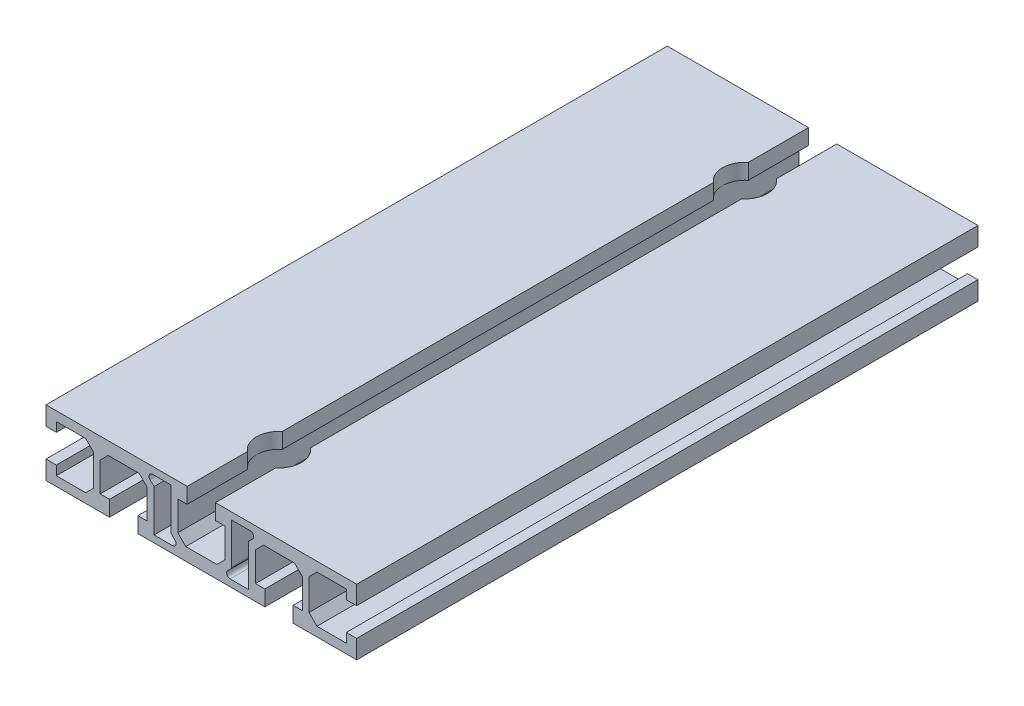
ISO-10303-21;
HEADER;
FILE_DESCRIPTION(('STEP AP214'),'2;1');
FILE_NAME('part.step','',(''),(''),'','','');
FILE_SCHEMA(('AUTOMOTIVE_DESIGN { 1 0 10303 214 1 1 1 1 }'));
ENDSEC;
DATA;
#1=APPLICATION_CONTEXT('core data for automotive mechanical design processes');
#2=APPLICATION_PROTOCOL_DEFINITION('international standard','automotive_design',2000,#1);
#3=PRODUCT_CONTEXT('',#1,'mechanical');
#4=PRODUCT('Part','Part','',(#3));
#5=PRODUCT_RELATED_PRODUCT_CATEGORY('part','',(#4));
#6=PRODUCT_DEFINITION_FORMATION('','',#4);
#7=PRODUCT_DEFINITION_CONTEXT('part definition',#1,'design');
#8=PRODUCT_DEFINITION('design','',#6,#7);
#9=PRODUCT_DEFINITION_SHAPE('','',#8);
#10=(LENGTH_UNIT() NAMED_UNIT(*) SI_UNIT(.MILLI.,.METRE.));
#11=(NAMED_UNIT(*) PLANE_ANGLE_UNIT() SI_UNIT($,.RADIAN.));
#12=(NAMED_UNIT(*) SI_UNIT($,.STERADIAN.) SOLID_ANGLE_UNIT());
#13=UNCERTAINTY_MEASURE_WITH_UNIT(LENGTH_MEASURE(1.E-05),#10,'distance_accuracy_value','');
#14=(GEOMETRIC_REPRESENTATION_CONTEXT(3) GLOBAL_UNCERTAINTY_ASSIGNED_CONTEXT((#13)) GLOBAL_UNIT_ASSIGNED_CONTEXT((#10,
#11,#12)) REPRESENTATION_CONTEXT('',''));
#15=CARTESIAN_POINT('',(0.,0.,0.));
#16=DIRECTION('',(0.,0.,1.));
#17=DIRECTION('',(1.,0.,0.));
#18=AXIS2_PLACEMENT_3D('',#15,#16,#17);
#19=CARTESIAN_POINT('',(4.10000000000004,9.5,-90.));
#20=DIRECTION('',(-1.,0.,0.));
#21=DIRECTION('',(0.,-1.,0.));
#22=AXIS2_PLACEMENT_3D('',#19,#20,#21);
#23=PLANE('',#22);
#24=DIRECTION('',(0.,-1.,0.));
#25=VECTOR('',#24,1.);
#26=CARTESIAN_POINT('',(4.10000000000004,9.50000000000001,-72.5438080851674));
#27=LINE('',#26,#25);
#28=CARTESIAN_POINT('',(4.10000000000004,9.50000000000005,-72.5438080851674));
#29=VERTEX_POINT('',#28);
#30=CARTESIAN_POINT('',(4.1,5.,-72.5438080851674));
#31=VERTEX_POINT('',#30);
#32=EDGE_CURVE('E1441',#29,#31,#27,.T.);
#33=ORIENTED_EDGE('',*,*,#32,.F.);
#34=DIRECTION('',(0.,0.,1.));
#35=VECTOR('',#34,1.);
#36=CARTESIAN_POINT('',(4.10000000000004,9.5,-90.));
#37=LINE('',#36,#35);
#38=CARTESIAN_POINT('',(4.10000000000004,9.5,-90.));
#39=VERTEX_POINT('',#38);
#40=EDGE_CURVE('E601',#39,#29,#37,.T.);
#41=ORIENTED_EDGE('',*,*,#40,.F.);
#42=DIRECTION('',(0.,-1.,0.));
#43=VECTOR('',#42,1.);
#44=CARTESIAN_POINT('',(4.10000000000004,9.5,-90.));
#45=LINE('',#44,#43);
#46=CARTESIAN_POINT('',(4.1,5.,-90.));
#47=VERTEX_POINT('',#46);
#48=EDGE_CURVE('E939',#39,#47,#45,.T.);
#49=ORIENTED_EDGE('',*,*,#48,.T.);
#50=DIRECTION('',(0.,0.,1.));
#51=VECTOR('',#50,1.);
#52=CARTESIAN_POINT('',(4.1,5.,-90.));
#53=LINE('',#52,#51);
#54=EDGE_CURVE('E596',#47,#31,#53,.T.);
#55=ORIENTED_EDGE('',*,*,#54,.T.);
#56=EDGE_LOOP('',(#33,#41,#49,#55));
#57=FACE_BOUND('',#56,.T.);
#58=ADVANCED_FACE('F30',(#57),#23,.T.);
#59=CARTESIAN_POINT('',(-4.09999999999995,4.99999999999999,-90.));
#60=DIRECTION('',(1.,0.,0.));
#61=DIRECTION('',(0.,1.,0.));
#62=AXIS2_PLACEMENT_3D('',#59,#60,#61);
#63=PLANE('',#62);
#64=DIRECTION('',(0.,-1.,0.));
#65=VECTOR('',#64,1.);
#66=CARTESIAN_POINT('',(-4.09999999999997,9.50000000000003,-62.4561919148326));
#67=LINE('',#66,#65);
#68=CARTESIAN_POINT('',(-4.09999999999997,9.50000000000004,-62.4561919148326));
#69=VERTEX_POINT('',#68);
#70=CARTESIAN_POINT('',(-4.09999999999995,4.99999999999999,-62.4561919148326));
#71=VERTEX_POINT('',#70);
#72=EDGE_CURVE('E47',#69,#71,#67,.T.);
#73=ORIENTED_EDGE('',*,*,#72,.F.);
#74=DIRECTION('',(0.,0.,1.));
#75=VECTOR('',#74,1.);
#76=CARTESIAN_POINT('',(-4.09999999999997,9.50000000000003,-90.));
#77=LINE('',#76,#75);
#78=CARTESIAN_POINT('',(-4.09999999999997,9.50000000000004,62.4561919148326));
#79=VERTEX_POINT('',#78);
#80=EDGE_CURVE('E558',#69,#79,#77,.T.);
#81=ORIENTED_EDGE('',*,*,#80,.T.);
#82=DIRECTION('',(0.,-1.,0.));
#83=VECTOR('',#82,1.);
#84=CARTESIAN_POINT('',(-4.09999999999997,9.50000000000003,62.4561919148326));
#85=LINE('',#84,#83);
#86=CARTESIAN_POINT('',(-4.09999999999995,4.99999999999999,62.4561919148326));
#87=VERTEX_POINT('',#86);
#88=EDGE_CURVE('E1166',#87,#79,#85,.F.);
#89=ORIENTED_EDGE('',*,*,#88,.F.);
#90=DIRECTION('',(0.,0.,1.));
#91=VECTOR('',#90,1.);
#92=CARTESIAN_POINT('',(-4.09999999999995,4.99999999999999,-90.));
#93=LINE('',#92,#91);
#94=EDGE_CURVE('E560',#71,#87,#93,.T.);
#95=ORIENTED_EDGE('',*,*,#94,.F.);
#96=EDGE_LOOP('',(#73,#81,#89,#95));
#97=FACE_BOUND('',#96,.T.);
#98=ADVANCED_FACE('F556',(#97),#63,.T.);
#99=CARTESIAN_POINT('',(4.50000000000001,-5.79999999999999,-90.));
#100=DIRECTION('',(0.,1.,0.));
#101=DIRECTION('',(-1.,0.,0.));
#102=AXIS2_PLACEMENT_3D('',#99,#100,#101);
#103=PLANE('',#102);
#104=CARTESIAN_POINT('',(0.,-5.79999999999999,-67.5));
#105=DIRECTION('',(0.,1.,0.));
#106=DIRECTION('',(-1.,0.,0.));
#107=AXIS2_PLACEMENT_3D('',#104,#105,#106);
#108=CIRCLE('',#107,6.5);
#109=CARTESIAN_POINT('',(-4.50000000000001,-5.79999999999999,-62.8095842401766));
#110=VERTEX_POINT('',#109);
#111=CARTESIAN_POINT('',(4.50000000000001,-5.79999999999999,-62.8095842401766));
#112=VERTEX_POINT('',#111);
#113=EDGE_CURVE('E55',#110,#112,#108,.T.);
#114=ORIENTED_EDGE('',*,*,#113,.F.);
#115=DIRECTION('',(0.,0.,1.));
#116=VECTOR('',#115,1.);
#117=CARTESIAN_POINT('',(-4.50000000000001,-5.79999999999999,-90.));
#118=LINE('',#117,#116);
#119=CARTESIAN_POINT('',(-4.50000000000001,-5.79999999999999,62.8095842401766));
#120=VERTEX_POINT('',#119);
#121=EDGE_CURVE('E585',#110,#120,#118,.T.);
#122=ORIENTED_EDGE('',*,*,#121,.T.);
#123=CARTESIAN_POINT('',(0.,-5.79999999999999,67.5));
#124=DIRECTION('',(0.,1.,0.));
#125=DIRECTION('',(-1.,0.,0.));
#126=AXIS2_PLACEMENT_3D('',#123,#124,#125);
#127=CIRCLE('',#126,6.5);
#128=CARTESIAN_POINT('',(4.50000000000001,-5.79999999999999,62.8095842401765));
#129=VERTEX_POINT('',#128);
#130=EDGE_CURVE('E1154',#129,#120,#127,.T.);
#131=ORIENTED_EDGE('',*,*,#130,.F.);
#132=DIRECTION('',(0.,0.,1.));
#133=VECTOR('',#132,1.);
#134=CARTESIAN_POINT('',(4.50000000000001,-5.79999999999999,-90.));
#135=LINE('',#134,#133);
#136=EDGE_CURVE('E590',#112,#129,#135,.T.);
#137=ORIENTED_EDGE('',*,*,#136,.F.);
#138=EDGE_LOOP('',(#114,#122,#131,#137));
#139=FACE_BOUND('',#138,.T.);
#140=ADVANCED_FACE('F1104',(#139),#103,.T.);
#141=DIRECTION('',(0.,-1.,0.));
#142=VECTOR('',#141,1.);
#143=CARTESIAN_POINT('',(-4.09999999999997,9.50000000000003,72.5438080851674));
#144=LINE('',#143,#142);
#145=CARTESIAN_POINT('',(-4.09999999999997,9.50000000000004,72.5438080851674));
#146=VERTEX_POINT('',#145);
#147=CARTESIAN_POINT('',(-4.09999999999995,4.99999999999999,72.5438080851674));
#148=VERTEX_POINT('',#147);
#149=EDGE_CURVE('E1168',#146,#148,#144,.T.);
#150=ORIENTED_EDGE('',*,*,#149,.F.);
#151=CARTESIAN_POINT('',(-4.09999999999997,9.50000000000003,90.));
#152=VERTEX_POINT('',#151);
#153=EDGE_CURVE('E568',#146,#152,#77,.T.);
#154=ORIENTED_EDGE('',*,*,#153,.T.);
#155=DIRECTION('',(0.,1.,0.));
#156=VECTOR('',#155,1.);
#157=CARTESIAN_POINT('',(-4.09999999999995,4.99999999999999,90.));
#158=LINE('',#157,#156);
#159=CARTESIAN_POINT('',(-4.09999999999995,4.99999999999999,90.));
#160=VERTEX_POINT('',#159);
#161=EDGE_CURVE('E722',#160,#152,#158,.T.);
#162=ORIENTED_EDGE('',*,*,#161,.F.);
#163=EDGE_CURVE('E577',#148,#160,#93,.T.);
#164=ORIENTED_EDGE('',*,*,#163,.F.);
#165=EDGE_LOOP('',(#150,#154,#162,#164));
#166=FACE_BOUND('',#165,.T.);
#167=ADVANCED_FACE('F1106',(#166),#63,.T.);
#168=CARTESIAN_POINT('',(-4.50000000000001,-5.79999999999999,72.1904157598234));
#169=VERTEX_POINT('',#168);
#170=CARTESIAN_POINT('',(4.50000000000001,-5.79999999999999,72.1904157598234));
#171=VERTEX_POINT('',#170);
#172=EDGE_CURVE('E1160',#169,#171,#127,.T.);
#173=ORIENTED_EDGE('',*,*,#172,.F.);
#174=CARTESIAN_POINT('',(-4.50000000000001,-5.79999999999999,90.));
#175=VERTEX_POINT('',#174);
#176=EDGE_CURVE('E586',#169,#175,#118,.T.);
#177=ORIENTED_EDGE('',*,*,#176,.T.);
#178=DIRECTION('',(-1.,0.,0.));
#179=VECTOR('',#178,1.);
#180=CARTESIAN_POINT('',(4.50000000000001,-5.79999999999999,90.));
#181=LINE('',#180,#179);
#182=CARTESIAN_POINT('',(4.50000000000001,-5.79999999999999,90.));
#183=VERTEX_POINT('',#182);
#184=EDGE_CURVE('E1300',#183,#175,#181,.T.);
#185=ORIENTED_EDGE('',*,*,#184,.F.);
#186=EDGE_CURVE('E591',#171,#183,#135,.T.);
#187=ORIENTED_EDGE('',*,*,#186,.F.);
#188=EDGE_LOOP('',(#173,#177,#185,#187));
#189=FACE_BOUND('',#188,.T.);
#190=ADVANCED_FACE('F1112',(#189),#103,.T.);
#191=DIRECTION('',(0.,-1.,0.));
#192=VECTOR('',#191,1.);
#193=CARTESIAN_POINT('',(4.10000000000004,9.50000000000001,-62.4561919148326));
#194=LINE('',#193,#192);
#195=CARTESIAN_POINT('',(4.1,5.,-62.4561919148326));
#196=VERTEX_POINT('',#195);
#197=CARTESIAN_POINT('',(4.10000000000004,9.5,-62.4561919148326));
#198=VERTEX_POINT('',#197);
#199=EDGE_CURVE('E1148',#196,#198,#194,.F.);
#200=ORIENTED_EDGE('',*,*,#199,.F.);
#201=CARTESIAN_POINT('',(4.1,5.,62.4561919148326));
#202=VERTEX_POINT('',#201);
#203=EDGE_CURVE('E599',#196,#202,#53,.T.);
#204=ORIENTED_EDGE('',*,*,#203,.T.);
#205=DIRECTION('',(0.,-1.,0.));
#206=VECTOR('',#205,1.);
#207=CARTESIAN_POINT('',(4.10000000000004,9.50000000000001,62.4561919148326));
#208=LINE('',#207,#206);
#209=CARTESIAN_POINT('',(4.10000000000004,9.50000000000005,62.4561919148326));
#210=VERTEX_POINT('',#209);
#211=EDGE_CURVE('E1147',#210,#202,#208,.T.);
#212=ORIENTED_EDGE('',*,*,#211,.F.);
#213=EDGE_CURVE('E604',#198,#210,#37,.T.);
#214=ORIENTED_EDGE('',*,*,#213,.F.);
#215=EDGE_LOOP('',(#200,#204,#212,#214));
#216=FACE_BOUND('',#215,.T.);
#217=ADVANCED_FACE('F1099',(#216),#23,.T.);
#218=CARTESIAN_POINT('',(-18.4,-5.,-90.));
#219=DIRECTION('',(-1.,0.,0.));
#220=DIRECTION('',(0.,-1.,0.));
#221=AXIS2_PLACEMENT_3D('',#218,#219,#220);
#222=PLANE('',#221);
#223=DIRECTION('',(0.,0.,1.));
#224=VECTOR('',#223,1.);
#225=CARTESIAN_POINT('',(-18.4,-9.50000000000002,-90.));
#226=LINE('',#225,#224);
#227=CARTESIAN_POINT('',(-18.4,-9.50000000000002,-90.));
#228=VERTEX_POINT('',#227);
#229=CARTESIAN_POINT('',(-18.4,-9.50000000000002,90.));
#230=VERTEX_POINT('',#229);
#231=EDGE_CURVE('E34',#228,#230,#226,.T.);
#232=ORIENTED_EDGE('',*,*,#231,.T.);
#233=DIRECTION('',(0.,-1.,0.));
#234=VECTOR('',#233,1.);
#235=CARTESIAN_POINT('',(-18.4,-5.,90.));
#236=LINE('',#235,#234);
#237=CARTESIAN_POINT('',(-18.4,-5.,90.));
#238=VERTEX_POINT('',#237);
#239=EDGE_CURVE('E1221',#238,#230,#236,.T.);
#240=ORIENTED_EDGE('',*,*,#239,.F.);
#241=DIRECTION('',(0.,0.,1.));
#242=VECTOR('',#241,1.);
#243=CARTESIAN_POINT('',(-18.4,-5.,-90.));
#244=LINE('',#243,#242);
#245=CARTESIAN_POINT('',(-18.4,-5.,-90.));
#246=VERTEX_POINT('',#245);
#247=EDGE_CURVE('E11',#246,#238,#244,.T.);
#248=ORIENTED_EDGE('',*,*,#247,.F.);
#249=DIRECTION('',(0.,-1.,0.));
#250=VECTOR('',#249,1.);
#251=CARTESIAN_POINT('',(-18.4,-5.,-90.));
#252=LINE('',#251,#250);
#253=EDGE_CURVE('E856',#246,#228,#252,.T.);
#254=ORIENTED_EDGE('',*,*,#253,.T.);
#255=EDGE_LOOP('',(#232,#240,#248,#254));
#256=FACE_BOUND('',#255,.T.);
#257=ADVANCED_FACE('F32',(#256),#222,.T.);
#258=CARTESIAN_POINT('',(-15.7,-5.,-90.));
#259=DIRECTION('',(0.,1.,0.));
#260=DIRECTION('',(-1.,0.,0.));
#261=AXIS2_PLACEMENT_3D('',#258,#259,#260);
#262=PLANE('',#261);
#263=ORIENTED_EDGE('',*,*,#247,.T.);
#264=DIRECTION('',(-1.,0.,0.));
#265=VECTOR('',#264,1.);
#266=CARTESIAN_POINT('',(-15.7,-5.,90.));
#267=LINE('',#266,#265);
#268=CARTESIAN_POINT('',(-15.7,-5.,90.));
#269=VERTEX_POINT('',#268);
#270=EDGE_CURVE('E781',#269,#238,#267,.T.);
#271=ORIENTED_EDGE('',*,*,#270,.F.);
#272=DIRECTION('',(0.,0.,1.));
#273=VECTOR('',#272,1.);
#274=CARTESIAN_POINT('',(-15.7,-5.,-90.));
#275=LINE('',#274,#273);
#276=CARTESIAN_POINT('',(-15.7,-5.,-90.));
#277=VERTEX_POINT('',#276);
#278=EDGE_CURVE('E39',#277,#269,#275,.T.);
#279=ORIENTED_EDGE('',*,*,#278,.F.);
#280=DIRECTION('',(-1.,0.,0.));
#281=VECTOR('',#280,1.);
#282=CARTESIAN_POINT('',(-15.7,-5.,-90.));
#283=LINE('',#282,#281);
#284=EDGE_CURVE('E652',#277,#246,#283,.T.);
#285=ORIENTED_EDGE('',*,*,#284,.T.);
#286=EDGE_LOOP('',(#263,#271,#279,#285));
#287=FACE_BOUND('',#286,.T.);
#288=ADVANCED_FACE('F2093',(#287),#262,.T.);
#289=CARTESIAN_POINT('',(-15.7,3.5,-90.));
#290=DIRECTION('',(-1.,0.,0.));
#291=DIRECTION('',(0.,-1.,0.));
#292=AXIS2_PLACEMENT_3D('',#289,#290,#291);
#293=PLANE('',#292);
#294=ORIENTED_EDGE('',*,*,#278,.T.);
#295=DIRECTION('',(0.,-1.,0.));
#296=VECTOR('',#295,1.);
#297=CARTESIAN_POINT('',(-15.7,3.5,90.));
#298=LINE('',#297,#296);
#299=CARTESIAN_POINT('',(-15.7,3.5,90.));
#300=VERTEX_POINT('',#299);
#301=EDGE_CURVE('E778',#300,#269,#298,.T.);
#302=ORIENTED_EDGE('',*,*,#301,.F.);
#303=DIRECTION('',(0.,0.,1.));
#304=VECTOR('',#303,1.);
#305=CARTESIAN_POINT('',(-15.7,3.5,-90.));
#306=LINE('',#305,#304);
#307=CARTESIAN_POINT('',(-15.7,3.5,-90.));
#308=VERTEX_POINT('',#307);
#309=EDGE_CURVE('E667',#308,#300,#306,.T.);
#310=ORIENTED_EDGE('',*,*,#309,.F.);
#311=DIRECTION('',(0.,-1.,0.));
#312=VECTOR('',#311,1.);
#313=CARTESIAN_POINT('',(-15.7,3.5,-90.));
#314=LINE('',#313,#312);
#315=EDGE_CURVE('E657',#308,#277,#314,.T.);
#316=ORIENTED_EDGE('',*,*,#315,.T.);
#317=EDGE_LOOP('',(#294,#302,#310,#316));
#318=FACE_BOUND('',#317,.T.);
#319=ADVANCED_FACE('F2084',(#318),#293,.T.);
#320=CARTESIAN_POINT('',(-18.,5.79999999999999,-90.));
#321=DIRECTION('',(-0.707106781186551,-0.707106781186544,0.));
#322=DIRECTION('',(0.707106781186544,-0.707106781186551,0.));
#323=AXIS2_PLACEMENT_3D('',#320,#321,#322);
#324=PLANE('',#323);
#325=ORIENTED_EDGE('',*,*,#309,.T.);
#326=DIRECTION('',(0.707106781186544,-0.707106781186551,0.));
#327=VECTOR('',#326,1.);
#328=CARTESIAN_POINT('',(-18.,5.79999999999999,90.));
#329=LINE('',#328,#327);
#330=CARTESIAN_POINT('',(-18.,5.79999999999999,90.));
#331=VERTEX_POINT('',#330);
#332=EDGE_CURVE('E775',#331,#300,#329,.T.);
#333=ORIENTED_EDGE('',*,*,#332,.F.);
#334=DIRECTION('',(0.,0.,1.));
#335=VECTOR('',#334,1.);
#336=CARTESIAN_POINT('',(-18.,5.79999999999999,-90.));
#337=LINE('',#336,#335);
#338=CARTESIAN_POINT('',(-18.,5.79999999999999,-90.));
#339=VERTEX_POINT('',#338);
#340=EDGE_CURVE('E669',#339,#331,#337,.T.);
#341=ORIENTED_EDGE('',*,*,#340,.F.);
#342=DIRECTION('',(0.707106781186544,-0.707106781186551,0.));
#343=VECTOR('',#342,1.);
#344=CARTESIAN_POINT('',(-18.,5.79999999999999,-90.));
#345=LINE('',#344,#343);
#346=EDGE_CURVE('E662',#339,#308,#345,.T.);
#347=ORIENTED_EDGE('',*,*,#346,.T.);
#348=EDGE_LOOP('',(#325,#333,#341,#347));
#349=FACE_BOUND('',#348,.T.);
#350=ADVANCED_FACE('F1019',(#349),#324,.T.);
#351=CARTESIAN_POINT('',(-27.,5.79999999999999,-90.));
#352=DIRECTION('',(0.,-1.,0.));
#353=DIRECTION('',(1.,0.,0.));
#354=AXIS2_PLACEMENT_3D('',#351,#352,#353);
#355=PLANE('',#354);
#356=ORIENTED_EDGE('',*,*,#340,.T.);
#357=DIRECTION('',(1.,0.,0.));
#358=VECTOR('',#357,1.);
#359=CARTESIAN_POINT('',(-27.,5.79999999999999,90.));
#360=LINE('',#359,#358);
#361=CARTESIAN_POINT('',(-27.,5.79999999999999,90.));
#362=VERTEX_POINT('',#361);
#363=EDGE_CURVE('E772',#362,#331,#360,.T.);
#364=ORIENTED_EDGE('',*,*,#363,.F.);
#365=DIRECTION('',(0.,0.,1.));
#366=VECTOR('',#365,1.);
#367=CARTESIAN_POINT('',(-27.,5.79999999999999,-90.));
#368=LINE('',#367,#366);
#369=CARTESIAN_POINT('',(-27.,5.79999999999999,-90.));
#370=VERTEX_POINT('',#369);
#371=EDGE_CURVE('E671',#370,#362,#368,.T.);
#372=ORIENTED_EDGE('',*,*,#371,.F.);
#373=DIRECTION('',(1.,0.,0.));
#374=VECTOR('',#373,1.);
#375=CARTESIAN_POINT('',(-27.,5.79999999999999,-90.));
#376=LINE('',#375,#374);
#377=EDGE_CURVE('E1014',#370,#339,#376,.T.);
#378=ORIENTED_EDGE('',*,*,#377,.T.);
#379=EDGE_LOOP('',(#356,#364,#372,#378));
#380=FACE_BOUND('',#379,.T.);
#381=ADVANCED_FACE('F1028',(#380),#355,.T.);
#382=CARTESIAN_POINT('',(-29.3,3.50000000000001,-90.));
#383=DIRECTION('',(0.707106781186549,-0.707106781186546,0.));
#384=DIRECTION('',(0.707106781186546,0.707106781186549,0.));
#385=AXIS2_PLACEMENT_3D('',#382,#383,#384);
#386=PLANE('',#385);
#387=ORIENTED_EDGE('',*,*,#371,.T.);
#388=DIRECTION('',(0.707106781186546,0.707106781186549,0.));
#389=VECTOR('',#388,1.);
#390=CARTESIAN_POINT('',(-29.3,3.50000000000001,90.));
#391=LINE('',#390,#389);
#392=CARTESIAN_POINT('',(-29.3,3.50000000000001,90.));
#393=VERTEX_POINT('',#392);
#394=EDGE_CURVE('E769',#393,#362,#391,.T.);
#395=ORIENTED_EDGE('',*,*,#394,.F.);
#396=DIRECTION('',(0.,0.,1.));
#397=VECTOR('',#396,1.);
#398=CARTESIAN_POINT('',(-29.3,3.50000000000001,-90.));
#399=LINE('',#398,#397);
#400=CARTESIAN_POINT('',(-29.3,3.50000000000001,-90.));
#401=VERTEX_POINT('',#400);
#402=EDGE_CURVE('E673',#401,#393,#399,.T.);
#403=ORIENTED_EDGE('',*,*,#402,.F.);
#404=DIRECTION('',(0.707106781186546,0.707106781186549,0.));
#405=VECTOR('',#404,1.);
#406=CARTESIAN_POINT('',(-29.3,3.50000000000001,-90.));
#407=LINE('',#406,#405);
#408=EDGE_CURVE('E1011',#401,#370,#407,.T.);
#409=ORIENTED_EDGE('',*,*,#408,.T.);
#410=EDGE_LOOP('',(#387,#395,#403,#409));
#411=FACE_BOUND('',#410,.T.);
#412=ADVANCED_FACE('F1032',(#411),#386,.T.);
#413=CARTESIAN_POINT('',(-29.2999999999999,-5.00000000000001,-90.));
#414=DIRECTION('',(1.,0.,0.));
#415=DIRECTION('',(0.,1.,0.));
#416=AXIS2_PLACEMENT_3D('',#413,#414,#415);
#417=PLANE('',#416);
#418=ORIENTED_EDGE('',*,*,#402,.T.);
#419=DIRECTION('',(0.,1.,0.));
#420=VECTOR('',#419,1.);
#421=CARTESIAN_POINT('',(-29.2999999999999,-5.00000000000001,90.));
#422=LINE('',#421,#420);
#423=CARTESIAN_POINT('',(-29.2999999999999,-5.00000000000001,90.));
#424=VERTEX_POINT('',#423);
#425=EDGE_CURVE('E766',#424,#393,#422,.T.);
#426=ORIENTED_EDGE('',*,*,#425,.F.);
#427=DIRECTION('',(0.,0.,1.));
#428=VECTOR('',#427,1.);
#429=CARTESIAN_POINT('',(-29.2999999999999,-5.00000000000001,-90.));
#430=LINE('',#429,#428);
#431=CARTESIAN_POINT('',(-29.2999999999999,-5.00000000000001,-90.));
#432=VERTEX_POINT('',#431);
#433=EDGE_CURVE('E675',#432,#424,#430,.T.);
#434=ORIENTED_EDGE('',*,*,#433,.F.);
#435=DIRECTION('',(0.,1.,0.));
#436=VECTOR('',#435,1.);
#437=CARTESIAN_POINT('',(-29.2999999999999,-5.00000000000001,-90.));
#438=LINE('',#437,#436);
#439=EDGE_CURVE('E1008',#432,#401,#438,.T.);
#440=ORIENTED_EDGE('',*,*,#439,.T.);
#441=EDGE_LOOP('',(#418,#426,#434,#440));
#442=FACE_BOUND('',#441,.T.);
#443=ADVANCED_FACE('F1036',(#442),#417,.T.);
#444=CARTESIAN_POINT('',(-26.6,-5.,-90.));
#445=DIRECTION('',(0.,1.,0.));
#446=DIRECTION('',(-1.,0.,0.));
#447=AXIS2_PLACEMENT_3D('',#444,#445,#446);
#448=PLANE('',#447);
#449=ORIENTED_EDGE('',*,*,#433,.T.);
#450=DIRECTION('',(-1.,0.,0.));
#451=VECTOR('',#450,1.);
#452=CARTESIAN_POINT('',(-26.6,-5.,90.));
#453=LINE('',#452,#451);
#454=CARTESIAN_POINT('',(-26.6,-5.,90.));
#455=VERTEX_POINT('',#454);
#456=EDGE_CURVE('E763',#455,#424,#453,.T.);
#457=ORIENTED_EDGE('',*,*,#456,.F.);
#458=DIRECTION('',(0.,0.,1.));
#459=VECTOR('',#458,1.);
#460=CARTESIAN_POINT('',(-26.6,-5.,-90.));
#461=LINE('',#460,#459);
#462=CARTESIAN_POINT('',(-26.6,-5.,-90.));
#463=VERTEX_POINT('',#462);
#464=EDGE_CURVE('E677',#463,#455,#461,.T.);
#465=ORIENTED_EDGE('',*,*,#464,.F.);
#466=DIRECTION('',(-1.,0.,0.));
#467=VECTOR('',#466,1.);
#468=CARTESIAN_POINT('',(-26.6,-5.,-90.));
#469=LINE('',#468,#467);
#470=EDGE_CURVE('E1005',#463,#432,#469,.T.);
#471=ORIENTED_EDGE('',*,*,#470,.T.);
#472=EDGE_LOOP('',(#449,#457,#465,#471));
#473=FACE_BOUND('',#472,.T.);
#474=ADVANCED_FACE('F1041',(#473),#448,.T.);
#475=CARTESIAN_POINT('',(-26.5999999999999,-9.50000000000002,-90.));
#476=DIRECTION('',(1.,0.,0.));
#477=DIRECTION('',(0.,1.,0.));
#478=AXIS2_PLACEMENT_3D('',#475,#476,#477);
#479=PLANE('',#478);
#480=ORIENTED_EDGE('',*,*,#464,.T.);
#481=DIRECTION('',(0.,1.,0.));
#482=VECTOR('',#481,1.);
#483=CARTESIAN_POINT('',(-26.5999999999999,-9.50000000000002,90.));
#484=LINE('',#483,#482);
#485=CARTESIAN_POINT('',(-26.5999999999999,-9.50000000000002,90.));
#486=VERTEX_POINT('',#485);
#487=EDGE_CURVE('E760',#486,#455,#484,.T.);
#488=ORIENTED_EDGE('',*,*,#487,.F.);
#489=DIRECTION('',(0.,0.,1.));
#490=VECTOR('',#489,1.);
#491=CARTESIAN_POINT('',(-26.5999999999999,-9.50000000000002,-90.));
#492=LINE('',#491,#490);
#493=CARTESIAN_POINT('',(-26.5999999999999,-9.50000000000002,-90.));
#494=VERTEX_POINT('',#493);
#495=EDGE_CURVE('E679',#494,#486,#492,.T.);
#496=ORIENTED_EDGE('',*,*,#495,.F.);
#497=DIRECTION('',(0.,1.,0.));
#498=VECTOR('',#497,1.);
#499=CARTESIAN_POINT('',(-26.5999999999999,-9.50000000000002,-90.));
#500=LINE('',#499,#498);
#501=EDGE_CURVE('E1002',#494,#463,#500,.T.);
#502=ORIENTED_EDGE('',*,*,#501,.T.);
#503=EDGE_LOOP('',(#480,#488,#496,#502));
#504=FACE_BOUND('',#503,.T.);
#505=ADVANCED_FACE('F1044',(#504),#479,.T.);
#506=CARTESIAN_POINT('',(-45.,-9.50000000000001,-90.));
#507=DIRECTION('',(0.,-1.,0.));
#508=DIRECTION('',(1.,0.,0.));
#509=AXIS2_PLACEMENT_3D('',#506,#507,#508);
#510=PLANE('',#509);
#511=ORIENTED_EDGE('',*,*,#495,.T.);
#512=DIRECTION('',(1.,0.,0.));
#513=VECTOR('',#512,1.);
#514=CARTESIAN_POINT('',(-45.,-9.50000000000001,90.));
#515=LINE('',#514,#513);
#516=CARTESIAN_POINT('',(-45.,-9.50000000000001,90.));
#517=VERTEX_POINT('',#516);
#518=EDGE_CURVE('E757',#517,#486,#515,.T.);
#519=ORIENTED_EDGE('',*,*,#518,.F.);
#520=DIRECTION('',(0.,0.,1.));
#521=VECTOR('',#520,1.);
#522=CARTESIAN_POINT('',(-45.,-9.50000000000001,-90.));
#523=LINE('',#522,#521);
#524=CARTESIAN_POINT('',(-45.,-9.50000000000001,-90.));
#525=VERTEX_POINT('',#524);
#526=EDGE_CURVE('E681',#525,#517,#523,.T.);
#527=ORIENTED_EDGE('',*,*,#526,.F.);
#528=DIRECTION('',(1.,0.,0.));
#529=VECTOR('',#528,1.);
#530=CARTESIAN_POINT('',(-45.,-9.50000000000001,-90.));
#531=LINE('',#530,#529);
#532=EDGE_CURVE('E999',#525,#494,#531,.T.);
#533=ORIENTED_EDGE('',*,*,#532,.T.);
#534=EDGE_LOOP('',(#511,#519,#527,#533));
#535=FACE_BOUND('',#534,.T.);
#536=ADVANCED_FACE('F1048',(#535),#510,.T.);
#537=CARTESIAN_POINT('',(-45.,-4.10000000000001,-90.));
#538=DIRECTION('',(-1.,0.,0.));
#539=DIRECTION('',(0.,-1.,0.));
#540=AXIS2_PLACEMENT_3D('',#537,#538,#539);
#541=PLANE('',#540);
#542=ORIENTED_EDGE('',*,*,#526,.T.);
#543=DIRECTION('',(0.,-1.,0.));
#544=VECTOR('',#543,1.);
#545=CARTESIAN_POINT('',(-45.,-4.10000000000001,90.));
#546=LINE('',#545,#544);
#547=CARTESIAN_POINT('',(-45.,-4.10000000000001,90.));
#548=VERTEX_POINT('',#547);
#549=EDGE_CURVE('E754',#548,#517,#546,.T.);
#550=ORIENTED_EDGE('',*,*,#549,.F.);
#551=DIRECTION('',(0.,0.,1.));
#552=VECTOR('',#551,1.);
#553=CARTESIAN_POINT('',(-45.,-4.10000000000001,-90.));
#554=LINE('',#553,#552);
#555=CARTESIAN_POINT('',(-45.,-4.10000000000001,-90.));
#556=VERTEX_POINT('',#555);
#557=EDGE_CURVE('E683',#556,#548,#554,.T.);
#558=ORIENTED_EDGE('',*,*,#557,.F.);
#559=DIRECTION('',(0.,-1.,0.));
#560=VECTOR('',#559,1.);
#561=CARTESIAN_POINT('',(-45.,-4.10000000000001,-90.));
#562=LINE('',#561,#560);
#563=EDGE_CURVE('E996',#556,#525,#562,.T.);
#564=ORIENTED_EDGE('',*,*,#563,.T.);
#565=EDGE_LOOP('',(#542,#550,#558,#564));
#566=FACE_BOUND('',#565,.T.);
#567=ADVANCED_FACE('F1053',(#566),#541,.T.);
#568=CARTESIAN_POINT('',(-42.0000000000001,-4.10000000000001,-90.));
#569=DIRECTION('',(0.,1.,0.));
#570=DIRECTION('',(0.,0.,1.));
#571=AXIS2_PLACEMENT_3D('',#568,#569,#570);
#572=PLANE('',#571);
#573=ORIENTED_EDGE('',*,*,#557,.T.);
#574=DIRECTION('',(-1.,0.,0.));
#575=VECTOR('',#574,1.);
#576=CARTESIAN_POINT('',(-42.0000000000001,-4.10000000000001,90.));
#577=LINE('',#576,#575);
#578=CARTESIAN_POINT('',(-42.0000000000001,-4.10000000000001,90.));
#579=VERTEX_POINT('',#578);
#580=EDGE_CURVE('E751',#579,#548,#577,.T.);
#581=ORIENTED_EDGE('',*,*,#580,.F.);
#582=DIRECTION('',(0.,0.,1.));
#583=VECTOR('',#582,1.);
#584=CARTESIAN_POINT('',(-42.0000000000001,-4.10000000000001,-90.));
#585=LINE('',#584,#583);
#586=CARTESIAN_POINT('',(-42.0000000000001,-4.10000000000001,-90.));
#587=VERTEX_POINT('',#586);
#588=EDGE_CURVE('E685',#587,#579,#585,.T.);
#589=ORIENTED_EDGE('',*,*,#588,.F.);
#590=DIRECTION('',(-1.,0.,0.));
#591=VECTOR('',#590,1.);
#592=CARTESIAN_POINT('',(-42.0000000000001,-4.10000000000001,-90.));
#593=LINE('',#592,#591);
#594=EDGE_CURVE('E993',#587,#556,#593,.T.);
#595=ORIENTED_EDGE('',*,*,#594,.T.);
#596=EDGE_LOOP('',(#573,#581,#589,#595));
#597=FACE_BOUND('',#596,.T.);
#598=ADVANCED_FACE('F1056',(#597),#572,.T.);
#599=CARTESIAN_POINT('',(-42.0000000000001,-6.79999999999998,-90.));
#600=DIRECTION('',(1.,0.,0.));
#601=DIRECTION('',(0.,1.,0.));
#602=AXIS2_PLACEMENT_3D('',#599,#600,#601);
#603=PLANE('',#602);
#604=ORIENTED_EDGE('',*,*,#588,.T.);
#605=DIRECTION('',(0.,1.,0.));
#606=VECTOR('',#605,1.);
#607=CARTESIAN_POINT('',(-42.0000000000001,-6.79999999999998,90.));
#608=LINE('',#607,#606);
#609=CARTESIAN_POINT('',(-42.0000000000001,-6.79999999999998,90.));
#610=VERTEX_POINT('',#609);
#611=EDGE_CURVE('E748',#610,#579,#608,.T.);
#612=ORIENTED_EDGE('',*,*,#611,.F.);
#613=DIRECTION('',(0.,0.,1.));
#614=VECTOR('',#613,1.);
#615=CARTESIAN_POINT('',(-42.0000000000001,-6.79999999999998,-90.));
#616=LINE('',#615,#614);
#617=CARTESIAN_POINT('',(-42.0000000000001,-6.79999999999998,-90.));
#618=VERTEX_POINT('',#617);
#619=EDGE_CURVE('E687',#618,#610,#616,.T.);
#620=ORIENTED_EDGE('',*,*,#619,.F.);
#621=DIRECTION('',(0.,1.,0.));
#622=VECTOR('',#621,1.);
#623=CARTESIAN_POINT('',(-42.0000000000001,-6.79999999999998,-90.));
#624=LINE('',#623,#622);
#625=EDGE_CURVE('E990',#618,#587,#624,.T.);
#626=ORIENTED_EDGE('',*,*,#625,.T.);
#627=EDGE_LOOP('',(#604,#612,#620,#626));
#628=FACE_BOUND('',#627,.T.);
#629=ADVANCED_FACE('F1060',(#628),#603,.T.);
#630=CARTESIAN_POINT('',(-33.5,-6.8,-90.));
#631=DIRECTION('',(0.,1.,0.));
#632=DIRECTION('',(-1.,0.,0.));
#633=AXIS2_PLACEMENT_3D('',#630,#631,#632);
#634=PLANE('',#633);
#635=ORIENTED_EDGE('',*,*,#619,.T.);
#636=DIRECTION('',(-1.,0.,0.));
#637=VECTOR('',#636,1.);
#638=CARTESIAN_POINT('',(-33.5,-6.8,90.));
#639=LINE('',#638,#637);
#640=CARTESIAN_POINT('',(-33.5,-6.8,90.));
#641=VERTEX_POINT('',#640);
#642=EDGE_CURVE('E745',#641,#610,#639,.T.);
#643=ORIENTED_EDGE('',*,*,#642,.F.);
#644=DIRECTION('',(0.,0.,1.));
#645=VECTOR('',#644,1.);
#646=CARTESIAN_POINT('',(-33.5,-6.8,-90.));
#647=LINE('',#646,#645);
#648=CARTESIAN_POINT('',(-33.5,-6.8,-90.));
#649=VERTEX_POINT('',#648);
#650=EDGE_CURVE('E689',#649,#641,#647,.T.);
#651=ORIENTED_EDGE('',*,*,#650,.F.);
#652=DIRECTION('',(-1.,0.,0.));
#653=VECTOR('',#652,1.);
#654=CARTESIAN_POINT('',(-33.5,-6.8,-90.));
#655=LINE('',#654,#653);
#656=EDGE_CURVE('E987',#649,#618,#655,.T.);
#657=ORIENTED_EDGE('',*,*,#656,.T.);
#658=EDGE_LOOP('',(#635,#643,#651,#657));
#659=FACE_BOUND('',#658,.T.);
#660=ADVANCED_FACE('F1065',(#659),#634,.T.);
#661=CARTESIAN_POINT('',(-31.2,-4.50000000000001,-90.));
#662=DIRECTION('',(-0.707106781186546,0.707106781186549,0.));
#663=DIRECTION('',(-0.707106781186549,-0.707106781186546,0.));
#664=AXIS2_PLACEMENT_3D('',#661,#662,#663);
#665=PLANE('',#664);
#666=ORIENTED_EDGE('',*,*,#650,.T.);
#667=DIRECTION('',(-0.707106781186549,-0.707106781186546,0.));
#668=VECTOR('',#667,1.);
#669=CARTESIAN_POINT('',(-31.2,-4.50000000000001,90.));
#670=LINE('',#669,#668);
#671=CARTESIAN_POINT('',(-31.2,-4.50000000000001,90.));
#672=VERTEX_POINT('',#671);
#673=EDGE_CURVE('E742',#672,#641,#670,.T.);
#674=ORIENTED_EDGE('',*,*,#673,.F.);
#675=DIRECTION('',(0.,0.,1.));
#676=VECTOR('',#675,1.);
#677=CARTESIAN_POINT('',(-31.2,-4.50000000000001,-90.));
#678=LINE('',#677,#676);
#679=CARTESIAN_POINT('',(-31.2,-4.50000000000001,-90.));
#680=VERTEX_POINT('',#679);
#681=EDGE_CURVE('E691',#680,#672,#678,.T.);
#682=ORIENTED_EDGE('',*,*,#681,.F.);
#683=DIRECTION('',(-0.707106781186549,-0.707106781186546,0.));
#684=VECTOR('',#683,1.);
#685=CARTESIAN_POINT('',(-31.2,-4.50000000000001,-90.));
#686=LINE('',#685,#684);
#687=EDGE_CURVE('E984',#680,#649,#686,.T.);
#688=ORIENTED_EDGE('',*,*,#687,.T.);
#689=EDGE_LOOP('',(#666,#674,#682,#688));
#690=FACE_BOUND('',#689,.T.);
#691=ADVANCED_FACE('F1068',(#690),#665,.T.);
#692=CARTESIAN_POINT('',(-31.2,4.50000000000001,-90.));
#693=DIRECTION('',(-1.,0.,0.));
#694=DIRECTION('',(0.,0.,1.));
#695=AXIS2_PLACEMENT_3D('',#692,#693,#694);
#696=PLANE('',#695);
#697=ORIENTED_EDGE('',*,*,#681,.T.);
#698=DIRECTION('',(0.,-1.,0.));
#699=VECTOR('',#698,1.);
#700=CARTESIAN_POINT('',(-31.2,4.50000000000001,90.));
#701=LINE('',#700,#699);
#702=CARTESIAN_POINT('',(-31.2,4.50000000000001,90.));
#703=VERTEX_POINT('',#702);
#704=EDGE_CURVE('E739',#703,#672,#701,.T.);
#705=ORIENTED_EDGE('',*,*,#704,.F.);
#706=DIRECTION('',(0.,0.,1.));
#707=VECTOR('',#706,1.);
#708=CARTESIAN_POINT('',(-31.2,4.50000000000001,-90.));
#709=LINE('',#708,#707);
#710=CARTESIAN_POINT('',(-31.2,4.50000000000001,-90.));
#711=VERTEX_POINT('',#710);
#712=EDGE_CURVE('E693',#711,#703,#709,.T.);
#713=ORIENTED_EDGE('',*,*,#712,.F.);
#714=DIRECTION('',(0.,-1.,0.));
#715=VECTOR('',#714,1.);
#716=CARTESIAN_POINT('',(-31.2,4.50000000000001,-90.));
#717=LINE('',#716,#715);
#718=EDGE_CURVE('E981',#711,#680,#717,.T.);
#719=ORIENTED_EDGE('',*,*,#718,.T.);
#720=EDGE_LOOP('',(#697,#705,#713,#719));
#721=FACE_BOUND('',#720,.T.);
#722=ADVANCED_FACE('F1072',(#721),#696,.T.);
#723=CARTESIAN_POINT('',(-33.5,6.8,-90.));
#724=DIRECTION('',(-0.707106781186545,-0.70710678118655,0.));
#725=DIRECTION('',(0.70710678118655,-0.707106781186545,0.));
#726=AXIS2_PLACEMENT_3D('',#723,#724,#725);
#727=PLANE('',#726);
#728=ORIENTED_EDGE('',*,*,#712,.T.);
#729=DIRECTION('',(0.70710678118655,-0.707106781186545,0.));
#730=VECTOR('',#729,1.);
#731=CARTESIAN_POINT('',(-33.5,6.8,90.));
#732=LINE('',#731,#730);
#733=CARTESIAN_POINT('',(-33.5,6.8,90.));
#734=VERTEX_POINT('',#733);
#735=EDGE_CURVE('E736',#734,#703,#732,.T.);
#736=ORIENTED_EDGE('',*,*,#735,.F.);
#737=DIRECTION('',(0.,0.,1.));
#738=VECTOR('',#737,1.);
#739=CARTESIAN_POINT('',(-33.5,6.8,-90.));
#740=LINE('',#739,#738);
#741=CARTESIAN_POINT('',(-33.5,6.8,-90.));
#742=VERTEX_POINT('',#741);
#743=EDGE_CURVE('E695',#742,#734,#740,.T.);
#744=ORIENTED_EDGE('',*,*,#743,.F.);
#745=DIRECTION('',(0.70710678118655,-0.707106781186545,0.));
#746=VECTOR('',#745,1.);
#747=CARTESIAN_POINT('',(-33.5,6.8,-90.));
#748=LINE('',#747,#746);
#749=EDGE_CURVE('E978',#742,#711,#748,.T.);
#750=ORIENTED_EDGE('',*,*,#749,.T.);
#751=EDGE_LOOP('',(#728,#736,#744,#750));
#752=FACE_BOUND('',#751,.T.);
#753=ADVANCED_FACE('F1077',(#752),#727,.T.);
#754=CARTESIAN_POINT('',(-42.,6.79999999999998,-90.));
#755=DIRECTION('',(0.,-1.,0.));
#756=DIRECTION('',(1.,0.,0.));
#757=AXIS2_PLACEMENT_3D('',#754,#755,#756);
#758=PLANE('',#757);
#759=ORIENTED_EDGE('',*,*,#743,.T.);
#760=DIRECTION('',(1.,0.,0.));
#761=VECTOR('',#760,1.);
#762=CARTESIAN_POINT('',(-42.,6.79999999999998,90.));
#763=LINE('',#762,#761);
#764=CARTESIAN_POINT('',(-42.,6.79999999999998,90.));
#765=VERTEX_POINT('',#764);
#766=EDGE_CURVE('E733',#765,#734,#763,.T.);
#767=ORIENTED_EDGE('',*,*,#766,.F.);
#768=DIRECTION('',(0.,0.,1.));
#769=VECTOR('',#768,1.);
#770=CARTESIAN_POINT('',(-42.,6.79999999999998,-90.));
#771=LINE('',#770,#769);
#772=CARTESIAN_POINT('',(-42.,6.79999999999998,-90.));
#773=VERTEX_POINT('',#772);
#774=EDGE_CURVE('E697',#773,#765,#771,.T.);
#775=ORIENTED_EDGE('',*,*,#774,.F.);
#776=DIRECTION('',(1.,0.,0.));
#777=VECTOR('',#776,1.);
#778=CARTESIAN_POINT('',(-42.,6.79999999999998,-90.));
#779=LINE('',#778,#777);
#780=EDGE_CURVE('E975',#773,#742,#779,.T.);
#781=ORIENTED_EDGE('',*,*,#780,.T.);
#782=EDGE_LOOP('',(#759,#767,#775,#781));
#783=FACE_BOUND('',#782,.T.);
#784=ADVANCED_FACE('F1080',(#783),#758,.T.);
#785=CARTESIAN_POINT('',(-42.,4.10000000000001,-90.));
#786=DIRECTION('',(1.,0.,0.));
#787=DIRECTION('',(0.,1.,0.));
#788=AXIS2_PLACEMENT_3D('',#785,#786,#787);
#789=PLANE('',#788);
#790=ORIENTED_EDGE('',*,*,#774,.T.);
#791=DIRECTION('',(0.,1.,0.));
#792=VECTOR('',#791,1.);
#793=CARTESIAN_POINT('',(-42.,4.10000000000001,90.));
#794=LINE('',#793,#792);
#795=CARTESIAN_POINT('',(-42.,4.10000000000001,90.));
#796=VERTEX_POINT('',#795);
#797=EDGE_CURVE('E727',#796,#765,#794,.T.);
#798=ORIENTED_EDGE('',*,*,#797,.F.);
#799=DIRECTION('',(0.,0.,1.));
#800=VECTOR('',#799,1.);
#801=CARTESIAN_POINT('',(-42.,4.10000000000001,-90.));
#802=LINE('',#801,#800);
#803=CARTESIAN_POINT('',(-42.,4.10000000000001,-90.));
#804=VERTEX_POINT('',#803);
#805=EDGE_CURVE('E699',#804,#796,#802,.T.);
#806=ORIENTED_EDGE('',*,*,#805,.F.);
#807=DIRECTION('',(0.,1.,0.));
#808=VECTOR('',#807,1.);
#809=CARTESIAN_POINT('',(-42.,4.10000000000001,-90.));
#810=LINE('',#809,#808);
#811=EDGE_CURVE('E972',#804,#773,#810,.T.);
#812=ORIENTED_EDGE('',*,*,#811,.T.);
#813=EDGE_LOOP('',(#790,#798,#806,#812));
#814=FACE_BOUND('',#813,.T.);
#815=ADVANCED_FACE('F1083',(#814),#789,.T.);
#816=CARTESIAN_POINT('',(-45.,4.10000000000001,-90.));
#817=DIRECTION('',(0.,-1.,0.));
#818=DIRECTION('',(0.,0.,-1.));
#819=AXIS2_PLACEMENT_3D('',#816,#817,#818);
#820=PLANE('',#819);
#821=ORIENTED_EDGE('',*,*,#805,.T.);
#822=DIRECTION('',(1.,0.,0.));
#823=VECTOR('',#822,1.);
#824=CARTESIAN_POINT('',(-45.,4.10000000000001,90.));
#825=LINE('',#824,#823);
#826=CARTESIAN_POINT('',(-45.,4.10000000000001,90.));
#827=VERTEX_POINT('',#826);
#828=EDGE_CURVE('E725',#827,#796,#825,.T.);
#829=ORIENTED_EDGE('',*,*,#828,.F.);
#830=DIRECTION('',(0.,0.,1.));
#831=VECTOR('',#830,1.);
#832=CARTESIAN_POINT('',(-45.,4.10000000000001,-90.));
#833=LINE('',#832,#831);
#834=CARTESIAN_POINT('',(-45.,4.10000000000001,-90.));
#835=VERTEX_POINT('',#834);
#836=EDGE_CURVE('E700',#835,#827,#833,.T.);
#837=ORIENTED_EDGE('',*,*,#836,.F.);
#838=DIRECTION('',(1.,0.,0.));
#839=VECTOR('',#838,1.);
#840=CARTESIAN_POINT('',(-45.,4.10000000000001,-90.));
#841=LINE('',#840,#839);
#842=EDGE_CURVE('E969',#835,#804,#841,.T.);
#843=ORIENTED_EDGE('',*,*,#842,.T.);
#844=EDGE_LOOP('',(#821,#829,#837,#843));
#845=FACE_BOUND('',#844,.T.);
#846=ADVANCED_FACE('F1087',(#845),#820,.T.);
#847=CARTESIAN_POINT('',(-45.,9.50000000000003,-90.));
#848=DIRECTION('',(-1.,0.,0.));
#849=DIRECTION('',(0.,0.,1.));
#850=AXIS2_PLACEMENT_3D('',#847,#848,#849);
#851=PLANE('',#850);
#852=ORIENTED_EDGE('',*,*,#836,.T.);
#853=DIRECTION('',(0.,-1.,0.));
#854=VECTOR('',#853,1.);
#855=CARTESIAN_POINT('',(-45.,9.50000000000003,90.));
#856=LINE('',#855,#854);
#857=CARTESIAN_POINT('',(-45.,9.50000000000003,90.));
#858=VERTEX_POINT('',#857);
#859=EDGE_CURVE('E718',#858,#827,#856,.T.);
#860=ORIENTED_EDGE('',*,*,#859,.F.);
#861=DIRECTION('',(0.,0.,1.));
#862=VECTOR('',#861,1.);
#863=CARTESIAN_POINT('',(-45.,9.50000000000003,-90.));
#864=LINE('',#863,#862);
#865=CARTESIAN_POINT('',(-45.,9.50000000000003,-90.));
#866=VERTEX_POINT('',#865);
#867=EDGE_CURVE('E570',#866,#858,#864,.T.);
#868=ORIENTED_EDGE('',*,*,#867,.F.);
#869=DIRECTION('',(0.,-1.,0.));
#870=VECTOR('',#869,1.);
#871=CARTESIAN_POINT('',(-45.,9.50000000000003,-90.));
#872=LINE('',#871,#870);
#873=EDGE_CURVE('E967',#866,#835,#872,.T.);
#874=ORIENTED_EDGE('',*,*,#873,.T.);
#875=EDGE_LOOP('',(#852,#860,#868,#874));
#876=FACE_BOUND('',#875,.T.);
#877=ADVANCED_FACE('F724',(#876),#851,.T.);
#878=CARTESIAN_POINT('',(-4.09999999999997,9.50000000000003,-90.));
#879=DIRECTION('',(0.,1.,0.));
#880=DIRECTION('',(0.,0.,1.));
#881=AXIS2_PLACEMENT_3D('',#878,#879,#880);
#882=PLANE('',#881);
#883=CARTESIAN_POINT('',(0.,9.50000000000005,-67.5));
#884=DIRECTION('',(0.,-1.,0.));
#885=DIRECTION('',(1.,0.,0.));
#886=AXIS2_PLACEMENT_3D('',#883,#884,#885);
#887=CIRCLE('',#886,6.5);
#888=CARTESIAN_POINT('',(-4.09999999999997,9.50000000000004,-72.5438080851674));
#889=VERTEX_POINT('',#888);
#890=EDGE_CURVE('E544',#69,#889,#887,.T.);
#891=ORIENTED_EDGE('',*,*,#890,.T.);
#892=CARTESIAN_POINT('',(-4.09999999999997,9.50000000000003,-90.));
#893=VERTEX_POINT('',#892);
#894=EDGE_CURVE('E567',#893,#889,#77,.T.);
#895=ORIENTED_EDGE('',*,*,#894,.F.);
#896=DIRECTION('',(-1.,0.,0.));
#897=VECTOR('',#896,1.);
#898=CARTESIAN_POINT('',(-4.09999999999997,9.50000000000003,-90.));
#899=LINE('',#898,#897);
#900=EDGE_CURVE('E710',#893,#866,#899,.T.);
#901=ORIENTED_EDGE('',*,*,#900,.T.);
#902=ORIENTED_EDGE('',*,*,#867,.T.);
#903=DIRECTION('',(-1.,0.,0.));
#904=VECTOR('',#903,1.);
#905=CARTESIAN_POINT('',(-4.09999999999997,9.50000000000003,90.));
#906=LINE('',#905,#904);
#907=EDGE_CURVE('E708',#152,#858,#906,.T.);
#908=ORIENTED_EDGE('',*,*,#907,.F.);
#909=ORIENTED_EDGE('',*,*,#153,.F.);
#910=CARTESIAN_POINT('',(0.,9.50000000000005,67.5));
#911=DIRECTION('',(0.,-1.,0.));
#912=DIRECTION('',(1.,0.,0.));
#913=AXIS2_PLACEMENT_3D('',#910,#911,#912);
#914=CIRCLE('',#913,6.5);
#915=EDGE_CURVE('E566',#146,#79,#914,.T.);
#916=ORIENTED_EDGE('',*,*,#915,.T.);
#917=ORIENTED_EDGE('',*,*,#80,.F.);
#918=EDGE_LOOP('',(#891,#895,#901,#902,#908,#909,#916,#917));
#919=FACE_BOUND('',#918,.T.);
#920=ADVANCED_FACE('F564',(#919),#882,.T.);
#921=DIRECTION('',(0.,-1.,0.));
#922=VECTOR('',#921,1.);
#923=CARTESIAN_POINT('',(-4.09999999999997,9.50000000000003,-72.5438080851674));
#924=LINE('',#923,#922);
#925=CARTESIAN_POINT('',(-4.09999999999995,4.99999999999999,-72.5438080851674));
#926=VERTEX_POINT('',#925);
#927=EDGE_CURVE('E547',#926,#889,#924,.F.);
#928=ORIENTED_EDGE('',*,*,#927,.F.);
#929=CARTESIAN_POINT('',(-4.09999999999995,4.99999999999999,-90.));
#930=VERTEX_POINT('',#929);
#931=EDGE_CURVE('E571',#930,#926,#93,.T.);
#932=ORIENTED_EDGE('',*,*,#931,.F.);
#933=DIRECTION('',(0.,1.,0.));
#934=VECTOR('',#933,1.);
#935=CARTESIAN_POINT('',(-4.09999999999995,4.99999999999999,-90.));
#936=LINE('',#935,#934);
#937=EDGE_CURVE('E963',#930,#893,#936,.T.);
#938=ORIENTED_EDGE('',*,*,#937,.T.);
#939=ORIENTED_EDGE('',*,*,#894,.T.);
#940=EDGE_LOOP('',(#928,#932,#938,#939));
#941=FACE_BOUND('',#940,.T.);
#942=ADVANCED_FACE('F1107',(#941),#63,.T.);
#943=CARTESIAN_POINT('',(-6.8,4.99999999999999,-90.));
#944=DIRECTION('',(0.,-1.,0.));
#945=DIRECTION('',(0.,0.,-1.));
#946=AXIS2_PLACEMENT_3D('',#943,#944,#945);
#947=PLANE('',#946);
#948=CARTESIAN_POINT('',(0.,4.99999999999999,-67.5));
#949=DIRECTION('',(0.,-1.,0.));
#950=DIRECTION('',(0.,0.,-1.));
#951=AXIS2_PLACEMENT_3D('',#948,#949,#950);
#952=CIRCLE('',#951,6.5);
#953=EDGE_CURVE('E1320',#71,#926,#952,.T.);
#954=ORIENTED_EDGE('',*,*,#953,.F.);
#955=ORIENTED_EDGE('',*,*,#94,.T.);
#956=CARTESIAN_POINT('',(0.,4.99999999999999,67.5));
#957=DIRECTION('',(0.,-1.,0.));
#958=DIRECTION('',(0.,0.,-1.));
#959=AXIS2_PLACEMENT_3D('',#956,#957,#958);
#960=CIRCLE('',#959,6.5);
#961=EDGE_CURVE('E1163',#148,#87,#960,.T.);
#962=ORIENTED_EDGE('',*,*,#961,.F.);
#963=ORIENTED_EDGE('',*,*,#163,.T.);
#964=DIRECTION('',(1.,0.,0.));
#965=VECTOR('',#964,1.);
#966=CARTESIAN_POINT('',(-6.8,4.99999999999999,90.));
#967=LINE('',#966,#965);
#968=CARTESIAN_POINT('',(-6.8,4.99999999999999,90.));
#969=VERTEX_POINT('',#968);
#970=EDGE_CURVE('E1309',#969,#160,#967,.T.);
#971=ORIENTED_EDGE('',*,*,#970,.F.);
#972=DIRECTION('',(0.,0.,1.));
#973=VECTOR('',#972,1.);
#974=CARTESIAN_POINT('',(-6.8,4.99999999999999,-90.));
#975=LINE('',#974,#973);
#976=CARTESIAN_POINT('',(-6.8,4.99999999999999,-90.));
#977=VERTEX_POINT('',#976);
#978=EDGE_CURVE('E578',#977,#969,#975,.T.);
#979=ORIENTED_EDGE('',*,*,#978,.F.);
#980=DIRECTION('',(1.,0.,0.));
#981=VECTOR('',#980,1.);
#982=CARTESIAN_POINT('',(-6.8,4.99999999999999,-90.));
#983=LINE('',#982,#981);
#984=EDGE_CURVE('E960',#977,#930,#983,.T.);
#985=ORIENTED_EDGE('',*,*,#984,.T.);
#986=ORIENTED_EDGE('',*,*,#931,.T.);
#987=EDGE_LOOP('',(#954,#955,#962,#963,#971,#979,#985,#986));
#988=FACE_BOUND('',#987,.T.);
#989=ADVANCED_FACE('F1319',(#988),#947,.T.);
#990=CARTESIAN_POINT('',(-6.8,-3.5,-90.));
#991=DIRECTION('',(1.,0.,0.));
#992=DIRECTION('',(0.,0.,-1.));
#993=AXIS2_PLACEMENT_3D('',#990,#991,#992);
#994=PLANE('',#993);
#995=ORIENTED_EDGE('',*,*,#978,.T.);
#996=DIRECTION('',(0.,1.,0.));
#997=VECTOR('',#996,1.);
#998=CARTESIAN_POINT('',(-6.8,-3.5,90.));
#999=LINE('',#998,#997);
#1000=CARTESIAN_POINT('',(-6.8,-3.5,90.));
#1001=VERTEX_POINT('',#1000);
#1002=EDGE_CURVE('E1306',#1001,#969,#999,.T.);
#1003=ORIENTED_EDGE('',*,*,#1002,.F.);
#1004=DIRECTION('',(0.,0.,1.));
#1005=VECTOR('',#1004,1.);
#1006=CARTESIAN_POINT('',(-6.8,-3.5,-90.));
#1007=LINE('',#1006,#1005);
#1008=CARTESIAN_POINT('',(-6.8,-3.5,-90.));
#1009=VERTEX_POINT('',#1008);
#1010=EDGE_CURVE('E580',#1009,#1001,#1007,.T.);
#1011=ORIENTED_EDGE('',*,*,#1010,.F.);
#1012=DIRECTION('',(0.,1.,0.));
#1013=VECTOR('',#1012,1.);
#1014=CARTESIAN_POINT('',(-6.8,-3.5,-90.));
#1015=LINE('',#1014,#1013);
#1016=EDGE_CURVE('E957',#1009,#977,#1015,.T.);
#1017=ORIENTED_EDGE('',*,*,#1016,.T.);
#1018=EDGE_LOOP('',(#995,#1003,#1011,#1017));
#1019=FACE_BOUND('',#1018,.T.);
#1020=ADVANCED_FACE('F1570',(#1019),#994,.T.);
#1021=CARTESIAN_POINT('',(-4.50000000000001,-5.79999999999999,-90.));
#1022=DIRECTION('',(0.707106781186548,0.707106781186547,0.));
#1023=DIRECTION('',(-0.707106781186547,0.707106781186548,0.));
#1024=AXIS2_PLACEMENT_3D('',#1021,#1022,#1023);
#1025=PLANE('',#1024);
#1026=CARTESIAN_POINT('',(0.,-10.3,-67.5));
#1027=DIRECTION('',(0.707106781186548,0.707106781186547,0.));
#1028=DIRECTION('',(0.707106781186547,-0.707106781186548,0.));
#1029=AXIS2_PLACEMENT_3D('',#1026,#1027,#1028);
#1030=ELLIPSE('',#1029,9.19238815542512,6.5);
#1031=CARTESIAN_POINT('',(-4.50000000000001,-5.79999999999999,-72.1904157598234));
#1032=VERTEX_POINT('',#1031);
#1033=EDGE_CURVE('E1321',#1032,#110,#1030,.T.);
#1034=ORIENTED_EDGE('',*,*,#1033,.F.);
#1035=CARTESIAN_POINT('',(-4.50000000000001,-5.79999999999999,-90.));
#1036=VERTEX_POINT('',#1035);
#1037=EDGE_CURVE('E582',#1036,#1032,#118,.T.);
#1038=ORIENTED_EDGE('',*,*,#1037,.F.);
#1039=DIRECTION('',(-0.707106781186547,0.707106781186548,0.));
#1040=VECTOR('',#1039,1.);
#1041=CARTESIAN_POINT('',(-4.50000000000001,-5.79999999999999,-90.));
#1042=LINE('',#1041,#1040);
#1043=EDGE_CURVE('E954',#1036,#1009,#1042,.T.);
#1044=ORIENTED_EDGE('',*,*,#1043,.T.);
#1045=ORIENTED_EDGE('',*,*,#1010,.T.);
#1046=DIRECTION('',(-0.707106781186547,0.707106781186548,0.));
#1047=VECTOR('',#1046,1.);
#1048=CARTESIAN_POINT('',(-4.50000000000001,-5.79999999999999,90.));
#1049=LINE('',#1048,#1047);
#1050=EDGE_CURVE('E1303',#175,#1001,#1049,.T.);
#1051=ORIENTED_EDGE('',*,*,#1050,.F.);
#1052=ORIENTED_EDGE('',*,*,#176,.F.);
#1053=CARTESIAN_POINT('',(0.,-10.3,67.5));
#1054=DIRECTION('',(0.707106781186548,0.707106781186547,0.));
#1055=DIRECTION('',(0.707106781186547,-0.707106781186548,0.));
#1056=AXIS2_PLACEMENT_3D('',#1053,#1054,#1055);
#1057=ELLIPSE('',#1056,9.19238815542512,6.5);
#1058=EDGE_CURVE('E1161',#120,#169,#1057,.T.);
#1059=ORIENTED_EDGE('',*,*,#1058,.F.);
#1060=ORIENTED_EDGE('',*,*,#121,.F.);
#1061=EDGE_LOOP('',(#1034,#1038,#1044,#1045,#1051,#1052,#1059,#1060));
#1062=FACE_BOUND('',#1061,.T.);
#1063=ADVANCED_FACE('F1452',(#1062),#1025,.T.);
#1064=CARTESIAN_POINT('',(4.50000000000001,-5.79999999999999,-72.1904157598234));
#1065=VERTEX_POINT('',#1064);
#1066=EDGE_CURVE('E1444',#1065,#1032,#108,.T.);
#1067=ORIENTED_EDGE('',*,*,#1066,.F.);
#1068=CARTESIAN_POINT('',(4.50000000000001,-5.79999999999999,-90.));
#1069=VERTEX_POINT('',#1068);
#1070=EDGE_CURVE('E587',#1069,#1065,#135,.T.);
#1071=ORIENTED_EDGE('',*,*,#1070,.F.);
#1072=DIRECTION('',(-1.,0.,0.));
#1073=VECTOR('',#1072,1.);
#1074=CARTESIAN_POINT('',(4.50000000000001,-5.79999999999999,-90.));
#1075=LINE('',#1074,#1073);
#1076=EDGE_CURVE('E951',#1069,#1036,#1075,.T.);
#1077=ORIENTED_EDGE('',*,*,#1076,.T.);
#1078=ORIENTED_EDGE('',*,*,#1037,.T.);
#1079=EDGE_LOOP('',(#1067,#1071,#1077,#1078));
#1080=FACE_BOUND('',#1079,.T.);
#1081=ADVANCED_FACE('F1455',(#1080),#103,.T.);
#1082=CARTESIAN_POINT('',(6.80000000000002,-3.49999999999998,-90.));
#1083=DIRECTION('',(-0.707106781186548,0.707106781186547,0.));
#1084=DIRECTION('',(-0.707106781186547,-0.707106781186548,0.));
#1085=AXIS2_PLACEMENT_3D('',#1082,#1083,#1084);
#1086=PLANE('',#1085);
#1087=CARTESIAN_POINT('',(0.,-10.3,-67.5));
#1088=DIRECTION('',(-0.707106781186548,0.707106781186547,0.));
#1089=DIRECTION('',(-0.707106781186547,-0.707106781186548,0.));
#1090=AXIS2_PLACEMENT_3D('',#1087,#1088,#1089);
#1091=ELLIPSE('',#1090,9.19238815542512,6.5);
#1092=EDGE_CURVE('E1443',#112,#1065,#1091,.T.);
#1093=ORIENTED_EDGE('',*,*,#1092,.F.);
#1094=ORIENTED_EDGE('',*,*,#136,.T.);
#1095=CARTESIAN_POINT('',(0.,-10.3,67.5));
#1096=DIRECTION('',(-0.707106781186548,0.707106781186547,0.));
#1097=DIRECTION('',(-0.707106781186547,-0.707106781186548,0.));
#1098=AXIS2_PLACEMENT_3D('',#1095,#1096,#1097);
#1099=ELLIPSE('',#1098,9.19238815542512,6.5);
#1100=EDGE_CURVE('E1151',#171,#129,#1099,.T.);
#1101=ORIENTED_EDGE('',*,*,#1100,.F.);
#1102=ORIENTED_EDGE('',*,*,#186,.T.);
#1103=DIRECTION('',(-0.707106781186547,-0.707106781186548,0.));
#1104=VECTOR('',#1103,1.);
#1105=CARTESIAN_POINT('',(6.80000000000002,-3.49999999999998,90.));
#1106=LINE('',#1105,#1104);
#1107=CARTESIAN_POINT('',(6.80000000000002,-3.49999999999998,90.));
#1108=VERTEX_POINT('',#1107);
#1109=EDGE_CURVE('E1297',#1108,#183,#1106,.T.);
#1110=ORIENTED_EDGE('',*,*,#1109,.F.);
#1111=DIRECTION('',(0.,0.,1.));
#1112=VECTOR('',#1111,1.);
#1113=CARTESIAN_POINT('',(6.80000000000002,-3.49999999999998,-90.));
#1114=LINE('',#1113,#1112);
#1115=CARTESIAN_POINT('',(6.80000000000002,-3.49999999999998,-90.));
#1116=VERTEX_POINT('',#1115);
#1117=EDGE_CURVE('E592',#1116,#1108,#1114,.T.);
#1118=ORIENTED_EDGE('',*,*,#1117,.F.);
#1119=DIRECTION('',(-0.707106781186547,-0.707106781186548,0.));
#1120=VECTOR('',#1119,1.);
#1121=CARTESIAN_POINT('',(6.80000000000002,-3.49999999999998,-90.));
#1122=LINE('',#1121,#1120);
#1123=EDGE_CURVE('E948',#1116,#1069,#1122,.T.);
#1124=ORIENTED_EDGE('',*,*,#1123,.T.);
#1125=ORIENTED_EDGE('',*,*,#1070,.T.);
#1126=EDGE_LOOP('',(#1093,#1094,#1101,#1102,#1110,#1118,#1124,#1125));
#1127=FACE_BOUND('',#1126,.T.);
#1128=ADVANCED_FACE('F1461',(#1127),#1086,.T.);
#1129=CARTESIAN_POINT('',(6.80000000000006,5.,-90.));
#1130=DIRECTION('',(-1.,0.,0.));
#1131=DIRECTION('',(0.,-1.,0.));
#1132=AXIS2_PLACEMENT_3D('',#1129,#1130,#1131);
#1133=PLANE('',#1132);
#1134=ORIENTED_EDGE('',*,*,#1117,.T.);
#1135=DIRECTION('',(0.,-1.,0.));
#1136=VECTOR('',#1135,1.);
#1137=CARTESIAN_POINT('',(6.80000000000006,5.,90.));
#1138=LINE('',#1137,#1136);
#1139=CARTESIAN_POINT('',(6.80000000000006,5.,90.));
#1140=VERTEX_POINT('',#1139);
#1141=EDGE_CURVE('E1294',#1140,#1108,#1138,.T.);
#1142=ORIENTED_EDGE('',*,*,#1141,.F.);
#1143=DIRECTION('',(0.,0.,1.));
#1144=VECTOR('',#1143,1.);
#1145=CARTESIAN_POINT('',(6.80000000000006,5.,-90.));
#1146=LINE('',#1145,#1144);
#1147=CARTESIAN_POINT('',(6.80000000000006,5.,-90.));
#1148=VERTEX_POINT('',#1147);
#1149=EDGE_CURVE('E594',#1148,#1140,#1146,.T.);
#1150=ORIENTED_EDGE('',*,*,#1149,.F.);
#1151=DIRECTION('',(0.,-1.,0.));
#1152=VECTOR('',#1151,1.);
#1153=CARTESIAN_POINT('',(6.80000000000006,5.,-90.));
#1154=LINE('',#1153,#1152);
#1155=EDGE_CURVE('E945',#1148,#1116,#1154,.T.);
#1156=ORIENTED_EDGE('',*,*,#1155,.T.);
#1157=EDGE_LOOP('',(#1134,#1142,#1150,#1156));
#1158=FACE_BOUND('',#1157,.T.);
#1159=ADVANCED_FACE('F1124',(#1158),#1133,.T.);
#1160=CARTESIAN_POINT('',(4.1,5.,-90.));
#1161=DIRECTION('',(0.,-1.,0.));
#1162=DIRECTION('',(1.,0.,0.));
#1163=AXIS2_PLACEMENT_3D('',#1160,#1161,#1162);
#1164=PLANE('',#1163);
#1165=CARTESIAN_POINT('',(0.,4.99999999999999,-67.5));
#1166=DIRECTION('',(0.,-1.,0.));
#1167=DIRECTION('',(1.,0.,0.));
#1168=AXIS2_PLACEMENT_3D('',#1165,#1166,#1167);
#1169=CIRCLE('',#1168,6.5);
#1170=EDGE_CURVE('E551',#31,#196,#1169,.T.);
#1171=ORIENTED_EDGE('',*,*,#1170,.F.);
#1172=ORIENTED_EDGE('',*,*,#54,.F.);
#1173=DIRECTION('',(1.,0.,0.));
#1174=VECTOR('',#1173,1.);
#1175=CARTESIAN_POINT('',(4.1,5.,-90.));
#1176=LINE('',#1175,#1174);
#1177=EDGE_CURVE('E942',#47,#1148,#1176,.T.);
#1178=ORIENTED_EDGE('',*,*,#1177,.T.);
#1179=ORIENTED_EDGE('',*,*,#1149,.T.);
#1180=DIRECTION('',(1.,0.,0.));
#1181=VECTOR('',#1180,1.);
#1182=CARTESIAN_POINT('',(4.1,5.,90.));
#1183=LINE('',#1182,#1181);
#1184=CARTESIAN_POINT('',(4.1,5.,90.));
#1185=VERTEX_POINT('',#1184);
#1186=EDGE_CURVE('E1142',#1185,#1140,#1183,.T.);
#1187=ORIENTED_EDGE('',*,*,#1186,.F.);
#1188=CARTESIAN_POINT('',(4.10000000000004,5.,72.5438080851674));
#1189=VERTEX_POINT('',#1188);
#1190=EDGE_CURVE('E600',#1189,#1185,#53,.T.);
#1191=ORIENTED_EDGE('',*,*,#1190,.F.);
#1192=CARTESIAN_POINT('',(0.,4.99999999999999,67.5));
#1193=DIRECTION('',(0.,-1.,0.));
#1194=DIRECTION('',(1.,0.,0.));
#1195=AXIS2_PLACEMENT_3D('',#1192,#1193,#1194);
#1196=CIRCLE('',#1195,6.5);
#1197=EDGE_CURVE('E1135',#202,#1189,#1196,.T.);
#1198=ORIENTED_EDGE('',*,*,#1197,.F.);
#1199=ORIENTED_EDGE('',*,*,#203,.F.);
#1200=EDGE_LOOP('',(#1171,#1172,#1178,#1179,#1187,#1191,#1198,#1199));
#1201=FACE_BOUND('',#1200,.T.);
#1202=ADVANCED_FACE('F1116',(#1201),#1164,.T.);
#1203=DIRECTION('',(0.,-1.,0.));
#1204=VECTOR('',#1203,1.);
#1205=CARTESIAN_POINT('',(4.10000000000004,9.50000000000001,72.5438080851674));
#1206=LINE('',#1205,#1204);
#1207=CARTESIAN_POINT('',(4.10000000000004,9.5,72.5438080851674));
#1208=VERTEX_POINT('',#1207);
#1209=EDGE_CURVE('E1128',#1189,#1208,#1206,.F.);
#1210=ORIENTED_EDGE('',*,*,#1209,.F.);
#1211=ORIENTED_EDGE('',*,*,#1190,.T.);
#1212=DIRECTION('',(0.,-1.,0.));
#1213=VECTOR('',#1212,1.);
#1214=CARTESIAN_POINT('',(4.10000000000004,9.5,90.));
#1215=LINE('',#1214,#1213);
#1216=CARTESIAN_POINT('',(4.10000000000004,9.5,90.));
#1217=VERTEX_POINT('',#1216);
#1218=EDGE_CURVE('E1291',#1217,#1185,#1215,.T.);
#1219=ORIENTED_EDGE('',*,*,#1218,.F.);
#1220=EDGE_CURVE('E605',#1208,#1217,#37,.T.);
#1221=ORIENTED_EDGE('',*,*,#1220,.F.);
#1222=EDGE_LOOP('',(#1210,#1211,#1219,#1221));
#1223=FACE_BOUND('',#1222,.T.);
#1224=ADVANCED_FACE('F1100',(#1223),#23,.T.);
#1225=CARTESIAN_POINT('',(45.,9.5,-90.));
#1226=DIRECTION('',(0.,1.,0.));
#1227=DIRECTION('',(0.,0.,1.));
#1228=AXIS2_PLACEMENT_3D('',#1225,#1226,#1227);
#1229=PLANE('',#1228);
#1230=EDGE_CURVE('E552',#29,#198,#887,.T.);
#1231=ORIENTED_EDGE('',*,*,#1230,.T.);
#1232=ORIENTED_EDGE('',*,*,#213,.T.);
#1233=EDGE_CURVE('E1150',#210,#1208,#914,.T.);
#1234=ORIENTED_EDGE('',*,*,#1233,.T.);
#1235=ORIENTED_EDGE('',*,*,#1220,.T.);
#1236=DIRECTION('',(-1.,0.,0.));
#1237=VECTOR('',#1236,1.);
#1238=CARTESIAN_POINT('',(45.,9.5,90.));
#1239=LINE('',#1238,#1237);
#1240=CARTESIAN_POINT('',(45.,9.5,90.));
#1241=VERTEX_POINT('',#1240);
#1242=EDGE_CURVE('E1288',#1241,#1217,#1239,.T.);
#1243=ORIENTED_EDGE('',*,*,#1242,.F.);
#1244=DIRECTION('',(0.,0.,1.));
#1245=VECTOR('',#1244,1.);
#1246=CARTESIAN_POINT('',(45.,9.5,-90.));
#1247=LINE('',#1246,#1245);
#1248=CARTESIAN_POINT('',(45.,9.5,-90.));
#1249=VERTEX_POINT('',#1248);
#1250=EDGE_CURVE('E606',#1249,#1241,#1247,.T.);
#1251=ORIENTED_EDGE('',*,*,#1250,.F.);
#1252=DIRECTION('',(-1.,0.,0.));
#1253=VECTOR('',#1252,1.);
#1254=CARTESIAN_POINT('',(45.,9.5,-90.));
#1255=LINE('',#1254,#1253);
#1256=EDGE_CURVE('E936',#1249,#39,#1255,.T.);
#1257=ORIENTED_EDGE('',*,*,#1256,.T.);
#1258=ORIENTED_EDGE('',*,*,#40,.T.);
#1259=EDGE_LOOP('',(#1231,#1232,#1234,#1235,#1243,#1251,#1257,#1258));
#1260=FACE_BOUND('',#1259,.T.);
#1261=ADVANCED_FACE('F1115',(#1260),#1229,.T.);
#1262=CARTESIAN_POINT('',(45.,4.10000000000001,-90.));
#1263=DIRECTION('',(1.,0.,0.));
#1264=DIRECTION('',(0.,1.,0.));
#1265=AXIS2_PLACEMENT_3D('',#1262,#1263,#1264);
#1266=PLANE('',#1265);
#1267=ORIENTED_EDGE('',*,*,#1250,.T.);
#1268=DIRECTION('',(0.,1.,0.));
#1269=VECTOR('',#1268,1.);
#1270=CARTESIAN_POINT('',(45.,4.10000000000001,90.));
#1271=LINE('',#1270,#1269);
#1272=CARTESIAN_POINT('',(45.,4.10000000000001,90.));
#1273=VERTEX_POINT('',#1272);
#1274=EDGE_CURVE('E1285',#1273,#1241,#1271,.T.);
#1275=ORIENTED_EDGE('',*,*,#1274,.F.);
#1276=DIRECTION('',(0.,0.,1.));
#1277=VECTOR('',#1276,1.);
#1278=CARTESIAN_POINT('',(45.,4.10000000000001,-90.));
#1279=LINE('',#1278,#1277);
#1280=CARTESIAN_POINT('',(45.,4.10000000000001,-90.));
#1281=VERTEX_POINT('',#1280);
#1282=EDGE_CURVE('E608',#1281,#1273,#1279,.T.);
#1283=ORIENTED_EDGE('',*,*,#1282,.F.);
#1284=DIRECTION('',(0.,1.,0.));
#1285=VECTOR('',#1284,1.);
#1286=CARTESIAN_POINT('',(45.,4.10000000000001,-90.));
#1287=LINE('',#1286,#1285);
#1288=EDGE_CURVE('E933',#1281,#1249,#1287,.T.);
#1289=ORIENTED_EDGE('',*,*,#1288,.T.);
#1290=EDGE_LOOP('',(#1267,#1275,#1283,#1289));
#1291=FACE_BOUND('',#1290,.T.);
#1292=ADVANCED_FACE('F1122',(#1291),#1266,.T.);
#1293=CARTESIAN_POINT('',(42.0000000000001,4.10000000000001,-90.));
#1294=DIRECTION('',(0.,-1.,0.));
#1295=DIRECTION('',(0.,0.,-1.));
#1296=AXIS2_PLACEMENT_3D('',#1293,#1294,#1295);
#1297=PLANE('',#1296);
#1298=ORIENTED_EDGE('',*,*,#1282,.T.);
#1299=DIRECTION('',(1.,0.,0.));
#1300=VECTOR('',#1299,1.);
#1301=CARTESIAN_POINT('',(42.0000000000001,4.10000000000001,90.));
#1302=LINE('',#1301,#1300);
#1303=CARTESIAN_POINT('',(42.0000000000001,4.10000000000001,90.));
#1304=VERTEX_POINT('',#1303);
#1305=EDGE_CURVE('E1282',#1304,#1273,#1302,.T.);
#1306=ORIENTED_EDGE('',*,*,#1305,.F.);
#1307=DIRECTION('',(0.,0.,1.));
#1308=VECTOR('',#1307,1.);
#1309=CARTESIAN_POINT('',(42.0000000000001,4.10000000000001,-90.));
#1310=LINE('',#1309,#1308);
#1311=CARTESIAN_POINT('',(42.0000000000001,4.10000000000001,-90.));
#1312=VERTEX_POINT('',#1311);
#1313=EDGE_CURVE('E610',#1312,#1304,#1310,.T.);
#1314=ORIENTED_EDGE('',*,*,#1313,.F.);
#1315=DIRECTION('',(1.,0.,0.));
#1316=VECTOR('',#1315,1.);
#1317=CARTESIAN_POINT('',(42.0000000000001,4.10000000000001,-90.));
#1318=LINE('',#1317,#1316);
#1319=EDGE_CURVE('E930',#1312,#1281,#1318,.T.);
#1320=ORIENTED_EDGE('',*,*,#1319,.T.);
#1321=EDGE_LOOP('',(#1298,#1306,#1314,#1320));
#1322=FACE_BOUND('',#1321,.T.);
#1323=ADVANCED_FACE('F1419',(#1322),#1297,.T.);
#1324=CARTESIAN_POINT('',(42.0000000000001,6.8,-90.));
#1325=DIRECTION('',(-1.,0.,0.));
#1326=DIRECTION('',(0.,-1.,0.));
#1327=AXIS2_PLACEMENT_3D('',#1324,#1325,#1326);
#1328=PLANE('',#1327);
#1329=ORIENTED_EDGE('',*,*,#1313,.T.);
#1330=DIRECTION('',(0.,-1.,0.));
#1331=VECTOR('',#1330,1.);
#1332=CARTESIAN_POINT('',(42.0000000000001,6.8,90.));
#1333=LINE('',#1332,#1331);
#1334=CARTESIAN_POINT('',(42.0000000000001,6.8,90.));
#1335=VERTEX_POINT('',#1334);
#1336=EDGE_CURVE('E1279',#1335,#1304,#1333,.T.);
#1337=ORIENTED_EDGE('',*,*,#1336,.F.);
#1338=DIRECTION('',(0.,0.,1.));
#1339=VECTOR('',#1338,1.);
#1340=CARTESIAN_POINT('',(42.0000000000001,6.8,-90.));
#1341=LINE('',#1340,#1339);
#1342=CARTESIAN_POINT('',(42.0000000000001,6.8,-90.));
#1343=VERTEX_POINT('',#1342);
#1344=EDGE_CURVE('E612',#1343,#1335,#1341,.T.);
#1345=ORIENTED_EDGE('',*,*,#1344,.F.);
#1346=DIRECTION('',(0.,-1.,0.));
#1347=VECTOR('',#1346,1.);
#1348=CARTESIAN_POINT('',(42.0000000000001,6.8,-90.));
#1349=LINE('',#1348,#1347);
#1350=EDGE_CURVE('E927',#1343,#1312,#1349,.T.);
#1351=ORIENTED_EDGE('',*,*,#1350,.T.);
#1352=EDGE_LOOP('',(#1329,#1337,#1345,#1351));
#1353=FACE_BOUND('',#1352,.T.);
#1354=ADVANCED_FACE('F1415',(#1353),#1328,.T.);
#1355=CARTESIAN_POINT('',(33.5,6.8,-90.));
#1356=DIRECTION('',(0.,-1.,0.));
#1357=DIRECTION('',(0.,0.,-1.));
#1358=AXIS2_PLACEMENT_3D('',#1355,#1356,#1357);
#1359=PLANE('',#1358);
#1360=ORIENTED_EDGE('',*,*,#1344,.T.);
#1361=DIRECTION('',(1.,0.,0.));
#1362=VECTOR('',#1361,1.);
#1363=CARTESIAN_POINT('',(33.5,6.8,90.));
#1364=LINE('',#1363,#1362);
#1365=CARTESIAN_POINT('',(33.5,6.8,90.));
#1366=VERTEX_POINT('',#1365);
#1367=EDGE_CURVE('E1276',#1366,#1335,#1364,.T.);
#1368=ORIENTED_EDGE('',*,*,#1367,.F.);
#1369=DIRECTION('',(0.,0.,1.));
#1370=VECTOR('',#1369,1.);
#1371=CARTESIAN_POINT('',(33.5,6.8,-90.));
#1372=LINE('',#1371,#1370);
#1373=CARTESIAN_POINT('',(33.5,6.8,-90.));
#1374=VERTEX_POINT('',#1373);
#1375=EDGE_CURVE('E614',#1374,#1366,#1372,.T.);
#1376=ORIENTED_EDGE('',*,*,#1375,.F.);
#1377=DIRECTION('',(1.,0.,0.));
#1378=VECTOR('',#1377,1.);
#1379=CARTESIAN_POINT('',(33.5,6.8,-90.));
#1380=LINE('',#1379,#1378);
#1381=EDGE_CURVE('E924',#1374,#1343,#1380,.T.);
#1382=ORIENTED_EDGE('',*,*,#1381,.T.);
#1383=EDGE_LOOP('',(#1360,#1368,#1376,#1382));
#1384=FACE_BOUND('',#1383,.T.);
#1385=ADVANCED_FACE('F1411',(#1384),#1359,.T.);
#1386=CARTESIAN_POINT('',(31.2,4.49999999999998,-90.));
#1387=DIRECTION('',(0.707106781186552,-0.707106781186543,0.));
#1388=DIRECTION('',(0.707106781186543,0.707106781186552,0.));
#1389=AXIS2_PLACEMENT_3D('',#1386,#1387,#1388);
#1390=PLANE('',#1389);
#1391=ORIENTED_EDGE('',*,*,#1375,.T.);
#1392=DIRECTION('',(0.707106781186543,0.707106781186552,0.));
#1393=VECTOR('',#1392,1.);
#1394=CARTESIAN_POINT('',(31.2,4.49999999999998,90.));
#1395=LINE('',#1394,#1393);
#1396=CARTESIAN_POINT('',(31.2,4.49999999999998,90.));
#1397=VERTEX_POINT('',#1396);
#1398=EDGE_CURVE('E1273',#1397,#1366,#1395,.T.);
#1399=ORIENTED_EDGE('',*,*,#1398,.F.);
#1400=DIRECTION('',(0.,0.,1.));
#1401=VECTOR('',#1400,1.);
#1402=CARTESIAN_POINT('',(31.2,4.49999999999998,-90.));
#1403=LINE('',#1402,#1401);
#1404=CARTESIAN_POINT('',(31.2,4.49999999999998,-90.));
#1405=VERTEX_POINT('',#1404);
#1406=EDGE_CURVE('E616',#1405,#1397,#1403,.T.);
#1407=ORIENTED_EDGE('',*,*,#1406,.F.);
#1408=DIRECTION('',(0.707106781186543,0.707106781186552,0.));
#1409=VECTOR('',#1408,1.);
#1410=CARTESIAN_POINT('',(31.2,4.49999999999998,-90.));
#1411=LINE('',#1410,#1409);
#1412=EDGE_CURVE('E921',#1405,#1374,#1411,.T.);
#1413=ORIENTED_EDGE('',*,*,#1412,.T.);
#1414=EDGE_LOOP('',(#1391,#1399,#1407,#1413));
#1415=FACE_BOUND('',#1414,.T.);
#1416=ADVANCED_FACE('F1407',(#1415),#1390,.T.);
#1417=CARTESIAN_POINT('',(31.2,-4.50000000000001,-90.));
#1418=DIRECTION('',(1.,0.,0.));
#1419=DIRECTION('',(0.,0.,-1.));
#1420=AXIS2_PLACEMENT_3D('',#1417,#1418,#1419);
#1421=PLANE('',#1420);
#1422=ORIENTED_EDGE('',*,*,#1406,.T.);
#1423=DIRECTION('',(0.,1.,0.));
#1424=VECTOR('',#1423,1.);
#1425=CARTESIAN_POINT('',(31.2,-4.50000000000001,90.));
#1426=LINE('',#1425,#1424);
#1427=CARTESIAN_POINT('',(31.2,-4.50000000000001,90.));
#1428=VERTEX_POINT('',#1427);
#1429=EDGE_CURVE('E1270',#1428,#1397,#1426,.T.);
#1430=ORIENTED_EDGE('',*,*,#1429,.F.);
#1431=DIRECTION('',(0.,0.,1.));
#1432=VECTOR('',#1431,1.);
#1433=CARTESIAN_POINT('',(31.2,-4.50000000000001,-90.));
#1434=LINE('',#1433,#1432);
#1435=CARTESIAN_POINT('',(31.2,-4.50000000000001,-90.));
#1436=VERTEX_POINT('',#1435);
#1437=EDGE_CURVE('E618',#1436,#1428,#1434,.T.);
#1438=ORIENTED_EDGE('',*,*,#1437,.F.);
#1439=DIRECTION('',(0.,1.,0.));
#1440=VECTOR('',#1439,1.);
#1441=CARTESIAN_POINT('',(31.2,-4.50000000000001,-90.));
#1442=LINE('',#1441,#1440);
#1443=EDGE_CURVE('E918',#1436,#1405,#1442,.T.);
#1444=ORIENTED_EDGE('',*,*,#1443,.T.);
#1445=EDGE_LOOP('',(#1422,#1430,#1438,#1444));
#1446=FACE_BOUND('',#1445,.T.);
#1447=ADVANCED_FACE('F1403',(#1446),#1421,.T.);
#1448=CARTESIAN_POINT('',(33.5,-6.8,-90.));
#1449=DIRECTION('',(0.707106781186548,0.707106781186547,0.));
#1450=DIRECTION('',(-0.707106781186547,0.707106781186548,0.));
#1451=AXIS2_PLACEMENT_3D('',#1448,#1449,#1450);
#1452=PLANE('',#1451);
#1453=ORIENTED_EDGE('',*,*,#1437,.T.);
#1454=DIRECTION('',(-0.707106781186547,0.707106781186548,0.));
#1455=VECTOR('',#1454,1.);
#1456=CARTESIAN_POINT('',(33.5,-6.8,90.));
#1457=LINE('',#1456,#1455);
#1458=CARTESIAN_POINT('',(33.5,-6.8,90.));
#1459=VERTEX_POINT('',#1458);
#1460=EDGE_CURVE('E1267',#1459,#1428,#1457,.T.);
#1461=ORIENTED_EDGE('',*,*,#1460,.F.);
#1462=DIRECTION('',(0.,0.,1.));
#1463=VECTOR('',#1462,1.);
#1464=CARTESIAN_POINT('',(33.5,-6.8,-90.));
#1465=LINE('',#1464,#1463);
#1466=CARTESIAN_POINT('',(33.5,-6.8,-90.));
#1467=VERTEX_POINT('',#1466);
#1468=EDGE_CURVE('E620',#1467,#1459,#1465,.T.);
#1469=ORIENTED_EDGE('',*,*,#1468,.F.);
#1470=DIRECTION('',(-0.707106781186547,0.707106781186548,0.));
#1471=VECTOR('',#1470,1.);
#1472=CARTESIAN_POINT('',(33.5,-6.8,-90.));
#1473=LINE('',#1472,#1471);
#1474=EDGE_CURVE('E915',#1467,#1436,#1473,.T.);
#1475=ORIENTED_EDGE('',*,*,#1474,.T.);
#1476=EDGE_LOOP('',(#1453,#1461,#1469,#1475));
#1477=FACE_BOUND('',#1476,.T.);
#1478=ADVANCED_FACE('F1399',(#1477),#1452,.T.);
#1479=CARTESIAN_POINT('',(42.,-6.8,-90.));
#1480=DIRECTION('',(0.,1.,0.));
#1481=DIRECTION('',(0.,0.,1.));
#1482=AXIS2_PLACEMENT_3D('',#1479,#1480,#1481);
#1483=PLANE('',#1482);
#1484=ORIENTED_EDGE('',*,*,#1468,.T.);
#1485=DIRECTION('',(-1.,0.,0.));
#1486=VECTOR('',#1485,1.);
#1487=CARTESIAN_POINT('',(42.,-6.8,90.));
#1488=LINE('',#1487,#1486);
#1489=CARTESIAN_POINT('',(42.,-6.8,90.));
#1490=VERTEX_POINT('',#1489);
#1491=EDGE_CURVE('E1264',#1490,#1459,#1488,.T.);
#1492=ORIENTED_EDGE('',*,*,#1491,.F.);
#1493=DIRECTION('',(0.,0.,1.));
#1494=VECTOR('',#1493,1.);
#1495=CARTESIAN_POINT('',(42.,-6.8,-90.));
#1496=LINE('',#1495,#1494);
#1497=CARTESIAN_POINT('',(42.,-6.8,-90.));
#1498=VERTEX_POINT('',#1497);
#1499=EDGE_CURVE('E622',#1498,#1490,#1496,.T.);
#1500=ORIENTED_EDGE('',*,*,#1499,.F.);
#1501=DIRECTION('',(-1.,0.,0.));
#1502=VECTOR('',#1501,1.);
#1503=CARTESIAN_POINT('',(42.,-6.8,-90.));
#1504=LINE('',#1503,#1502);
#1505=EDGE_CURVE('E912',#1498,#1467,#1504,.T.);
#1506=ORIENTED_EDGE('',*,*,#1505,.T.);
#1507=EDGE_LOOP('',(#1484,#1492,#1500,#1506));
#1508=FACE_BOUND('',#1507,.T.);
#1509=ADVANCED_FACE('F1395',(#1508),#1483,.T.);
#1510=CARTESIAN_POINT('',(42.,-4.10000000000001,-90.));
#1511=DIRECTION('',(-1.,0.,0.));
#1512=DIRECTION('',(0.,-1.,0.));
#1513=AXIS2_PLACEMENT_3D('',#1510,#1511,#1512);
#1514=PLANE('',#1513);
#1515=ORIENTED_EDGE('',*,*,#1499,.T.);
#1516=DIRECTION('',(0.,-1.,0.));
#1517=VECTOR('',#1516,1.);
#1518=CARTESIAN_POINT('',(42.,-4.10000000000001,90.));
#1519=LINE('',#1518,#1517);
#1520=CARTESIAN_POINT('',(42.,-4.10000000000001,90.));
#1521=VERTEX_POINT('',#1520);
#1522=EDGE_CURVE('E1261',#1521,#1490,#1519,.T.);
#1523=ORIENTED_EDGE('',*,*,#1522,.F.);
#1524=DIRECTION('',(0.,0.,1.));
#1525=VECTOR('',#1524,1.);
#1526=CARTESIAN_POINT('',(42.,-4.10000000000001,-90.));
#1527=LINE('',#1526,#1525);
#1528=CARTESIAN_POINT('',(42.,-4.10000000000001,-90.));
#1529=VERTEX_POINT('',#1528);
#1530=EDGE_CURVE('E624',#1529,#1521,#1527,.T.);
#1531=ORIENTED_EDGE('',*,*,#1530,.F.);
#1532=DIRECTION('',(0.,-1.,0.));
#1533=VECTOR('',#1532,1.);
#1534=CARTESIAN_POINT('',(42.,-4.10000000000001,-90.));
#1535=LINE('',#1534,#1533);
#1536=EDGE_CURVE('E909',#1529,#1498,#1535,.T.);
#1537=ORIENTED_EDGE('',*,*,#1536,.T.);
#1538=EDGE_LOOP('',(#1515,#1523,#1531,#1537));
#1539=FACE_BOUND('',#1538,.T.);
#1540=ADVANCED_FACE('F1391',(#1539),#1514,.T.);
#1541=CARTESIAN_POINT('',(45.,-4.10000000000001,-90.));
#1542=DIRECTION('',(0.,1.,0.));
#1543=DIRECTION('',(0.,0.,1.));
#1544=AXIS2_PLACEMENT_3D('',#1541,#1542,#1543);
#1545=PLANE('',#1544);
#1546=ORIENTED_EDGE('',*,*,#1530,.T.);
#1547=DIRECTION('',(-1.,0.,0.));
#1548=VECTOR('',#1547,1.);
#1549=CARTESIAN_POINT('',(45.,-4.10000000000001,90.));
#1550=LINE('',#1549,#1548);
#1551=CARTESIAN_POINT('',(45.,-4.10000000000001,90.));
#1552=VERTEX_POINT('',#1551);
#1553=EDGE_CURVE('E1258',#1552,#1521,#1550,.T.);
#1554=ORIENTED_EDGE('',*,*,#1553,.F.);
#1555=DIRECTION('',(0.,0.,1.));
#1556=VECTOR('',#1555,1.);
#1557=CARTESIAN_POINT('',(45.,-4.10000000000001,-90.));
#1558=LINE('',#1557,#1556);
#1559=CARTESIAN_POINT('',(45.,-4.10000000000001,-90.));
#1560=VERTEX_POINT('',#1559);
#1561=EDGE_CURVE('E626',#1560,#1552,#1558,.T.);
#1562=ORIENTED_EDGE('',*,*,#1561,.F.);
#1563=DIRECTION('',(-1.,0.,0.));
#1564=VECTOR('',#1563,1.);
#1565=CARTESIAN_POINT('',(45.,-4.10000000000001,-90.));
#1566=LINE('',#1565,#1564);
#1567=EDGE_CURVE('E906',#1560,#1529,#1566,.T.);
#1568=ORIENTED_EDGE('',*,*,#1567,.T.);
#1569=EDGE_LOOP('',(#1546,#1554,#1562,#1568));
#1570=FACE_BOUND('',#1569,.T.);
#1571=ADVANCED_FACE('F1387',(#1570),#1545,.T.);
#1572=CARTESIAN_POINT('',(45.,-9.5,-90.));
#1573=DIRECTION('',(1.,0.,0.));
#1574=DIRECTION('',(0.,1.,0.));
#1575=AXIS2_PLACEMENT_3D('',#1572,#1573,#1574);
#1576=PLANE('',#1575);
#1577=ORIENTED_EDGE('',*,*,#1561,.T.);
#1578=DIRECTION('',(0.,1.,0.));
#1579=VECTOR('',#1578,1.);
#1580=CARTESIAN_POINT('',(45.,-9.5,90.));
#1581=LINE('',#1580,#1579);
#1582=CARTESIAN_POINT('',(45.,-9.5,90.));
#1583=VERTEX_POINT('',#1582);
#1584=EDGE_CURVE('E1255',#1583,#1552,#1581,.T.);
#1585=ORIENTED_EDGE('',*,*,#1584,.F.);
#1586=DIRECTION('',(0.,0.,1.));
#1587=VECTOR('',#1586,1.);
#1588=CARTESIAN_POINT('',(45.,-9.5,-90.));
#1589=LINE('',#1588,#1587);
#1590=CARTESIAN_POINT('',(45.,-9.5,-90.));
#1591=VERTEX_POINT('',#1590);
#1592=EDGE_CURVE('E628',#1591,#1583,#1589,.T.);
#1593=ORIENTED_EDGE('',*,*,#1592,.F.);
#1594=DIRECTION('',(0.,1.,0.));
#1595=VECTOR('',#1594,1.);
#1596=CARTESIAN_POINT('',(45.,-9.5,-90.));
#1597=LINE('',#1596,#1595);
#1598=EDGE_CURVE('E903',#1591,#1560,#1597,.T.);
#1599=ORIENTED_EDGE('',*,*,#1598,.T.);
#1600=EDGE_LOOP('',(#1577,#1585,#1593,#1599));
#1601=FACE_BOUND('',#1600,.T.);
#1602=ADVANCED_FACE('F1383',(#1601),#1576,.T.);
#1603=CARTESIAN_POINT('',(26.6,-9.5,-90.));
#1604=DIRECTION('',(0.,-1.,0.));
#1605=DIRECTION('',(0.,0.,-1.));
#1606=AXIS2_PLACEMENT_3D('',#1603,#1604,#1605);
#1607=PLANE('',#1606);
#1608=ORIENTED_EDGE('',*,*,#1592,.T.);
#1609=DIRECTION('',(1.,0.,0.));
#1610=VECTOR('',#1609,1.);
#1611=CARTESIAN_POINT('',(26.6,-9.5,90.));
#1612=LINE('',#1611,#1610);
#1613=CARTESIAN_POINT('',(26.6,-9.5,90.));
#1614=VERTEX_POINT('',#1613);
#1615=EDGE_CURVE('E1252',#1614,#1583,#1612,.T.);
#1616=ORIENTED_EDGE('',*,*,#1615,.F.);
#1617=DIRECTION('',(0.,0.,1.));
#1618=VECTOR('',#1617,1.);
#1619=CARTESIAN_POINT('',(26.6,-9.5,-90.));
#1620=LINE('',#1619,#1618);
#1621=CARTESIAN_POINT('',(26.6,-9.5,-90.));
#1622=VERTEX_POINT('',#1621);
#1623=EDGE_CURVE('E630',#1622,#1614,#1620,.T.);
#1624=ORIENTED_EDGE('',*,*,#1623,.F.);
#1625=DIRECTION('',(1.,0.,0.));
#1626=VECTOR('',#1625,1.);
#1627=CARTESIAN_POINT('',(26.6,-9.5,-90.));
#1628=LINE('',#1627,#1626);
#1629=EDGE_CURVE('E900',#1622,#1591,#1628,.T.);
#1630=ORIENTED_EDGE('',*,*,#1629,.T.);
#1631=EDGE_LOOP('',(#1608,#1616,#1624,#1630));
#1632=FACE_BOUND('',#1631,.T.);
#1633=ADVANCED_FACE('F1379',(#1632),#1607,.T.);
#1634=CARTESIAN_POINT('',(26.6,-5.00000000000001,-90.));
#1635=DIRECTION('',(-1.,0.,0.));
#1636=DIRECTION('',(0.,-1.,0.));
#1637=AXIS2_PLACEMENT_3D('',#1634,#1635,#1636);
#1638=PLANE('',#1637);
#1639=ORIENTED_EDGE('',*,*,#1623,.T.);
#1640=DIRECTION('',(0.,-1.,0.));
#1641=VECTOR('',#1640,1.);
#1642=CARTESIAN_POINT('',(26.6,-5.00000000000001,90.));
#1643=LINE('',#1642,#1641);
#1644=CARTESIAN_POINT('',(26.6,-5.00000000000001,90.));
#1645=VERTEX_POINT('',#1644);
#1646=EDGE_CURVE('E1249',#1645,#1614,#1643,.T.);
#1647=ORIENTED_EDGE('',*,*,#1646,.F.);
#1648=DIRECTION('',(0.,0.,1.));
#1649=VECTOR('',#1648,1.);
#1650=CARTESIAN_POINT('',(26.6,-5.00000000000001,-90.));
#1651=LINE('',#1650,#1649);
#1652=CARTESIAN_POINT('',(26.6,-5.00000000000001,-90.));
#1653=VERTEX_POINT('',#1652);
#1654=EDGE_CURVE('E632',#1653,#1645,#1651,.T.);
#1655=ORIENTED_EDGE('',*,*,#1654,.F.);
#1656=DIRECTION('',(0.,-1.,0.));
#1657=VECTOR('',#1656,1.);
#1658=CARTESIAN_POINT('',(26.6,-5.00000000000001,-90.));
#1659=LINE('',#1658,#1657);
#1660=EDGE_CURVE('E897',#1653,#1622,#1659,.T.);
#1661=ORIENTED_EDGE('',*,*,#1660,.T.);
#1662=EDGE_LOOP('',(#1639,#1647,#1655,#1661));
#1663=FACE_BOUND('',#1662,.T.);
#1664=ADVANCED_FACE('F1375',(#1663),#1638,.T.);
#1665=CARTESIAN_POINT('',(29.3,-5.,-90.));
#1666=DIRECTION('',(0.,1.,0.));
#1667=DIRECTION('',(-1.,0.,0.));
#1668=AXIS2_PLACEMENT_3D('',#1665,#1666,#1667);
#1669=PLANE('',#1668);
#1670=ORIENTED_EDGE('',*,*,#1654,.T.);
#1671=DIRECTION('',(-1.,0.,0.));
#1672=VECTOR('',#1671,1.);
#1673=CARTESIAN_POINT('',(29.3,-5.,90.));
#1674=LINE('',#1673,#1672);
#1675=CARTESIAN_POINT('',(29.3,-5.,90.));
#1676=VERTEX_POINT('',#1675);
#1677=EDGE_CURVE('E1246',#1676,#1645,#1674,.T.);
#1678=ORIENTED_EDGE('',*,*,#1677,.F.);
#1679=DIRECTION('',(0.,0.,1.));
#1680=VECTOR('',#1679,1.);
#1681=CARTESIAN_POINT('',(29.3,-5.,-90.));
#1682=LINE('',#1681,#1680);
#1683=CARTESIAN_POINT('',(29.3,-5.,-90.));
#1684=VERTEX_POINT('',#1683);
#1685=EDGE_CURVE('E634',#1684,#1676,#1682,.T.);
#1686=ORIENTED_EDGE('',*,*,#1685,.F.);
#1687=DIRECTION('',(-1.,0.,0.));
#1688=VECTOR('',#1687,1.);
#1689=CARTESIAN_POINT('',(29.3,-5.,-90.));
#1690=LINE('',#1689,#1688);
#1691=EDGE_CURVE('E894',#1684,#1653,#1690,.T.);
#1692=ORIENTED_EDGE('',*,*,#1691,.T.);
#1693=EDGE_LOOP('',(#1670,#1678,#1686,#1692));
#1694=FACE_BOUND('',#1693,.T.);
#1695=ADVANCED_FACE('F1371',(#1694),#1669,.T.);
#1696=CARTESIAN_POINT('',(29.3,3.5,-90.));
#1697=DIRECTION('',(-1.,0.,0.));
#1698=DIRECTION('',(0.,0.,1.));
#1699=AXIS2_PLACEMENT_3D('',#1696,#1697,#1698);
#1700=PLANE('',#1699);
#1701=ORIENTED_EDGE('',*,*,#1685,.T.);
#1702=DIRECTION('',(0.,-1.,0.));
#1703=VECTOR('',#1702,1.);
#1704=CARTESIAN_POINT('',(29.3,3.5,90.));
#1705=LINE('',#1704,#1703);
#1706=CARTESIAN_POINT('',(29.3,3.5,90.));
#1707=VERTEX_POINT('',#1706);
#1708=EDGE_CURVE('E1243',#1707,#1676,#1705,.T.);
#1709=ORIENTED_EDGE('',*,*,#1708,.F.);
#1710=DIRECTION('',(0.,0.,1.));
#1711=VECTOR('',#1710,1.);
#1712=CARTESIAN_POINT('',(29.3,3.5,-90.));
#1713=LINE('',#1712,#1711);
#1714=CARTESIAN_POINT('',(29.3,3.5,-90.));
#1715=VERTEX_POINT('',#1714);
#1716=EDGE_CURVE('E636',#1715,#1707,#1713,.T.);
#1717=ORIENTED_EDGE('',*,*,#1716,.F.);
#1718=DIRECTION('',(0.,-1.,0.));
#1719=VECTOR('',#1718,1.);
#1720=CARTESIAN_POINT('',(29.3,3.5,-90.));
#1721=LINE('',#1720,#1719);
#1722=EDGE_CURVE('E891',#1715,#1684,#1721,.T.);
#1723=ORIENTED_EDGE('',*,*,#1722,.T.);
#1724=EDGE_LOOP('',(#1701,#1709,#1717,#1723));
#1725=FACE_BOUND('',#1724,.T.);
#1726=ADVANCED_FACE('F1367',(#1725),#1700,.T.);
#1727=CARTESIAN_POINT('',(27.,5.80000000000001,-90.));
#1728=DIRECTION('',(-0.707106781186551,-0.707106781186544,0.));
#1729=DIRECTION('',(0.707106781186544,-0.707106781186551,0.));
#1730=AXIS2_PLACEMENT_3D('',#1727,#1728,#1729);
#1731=PLANE('',#1730);
#1732=ORIENTED_EDGE('',*,*,#1716,.T.);
#1733=DIRECTION('',(0.707106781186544,-0.707106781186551,0.));
#1734=VECTOR('',#1733,1.);
#1735=CARTESIAN_POINT('',(27.,5.80000000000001,90.));
#1736=LINE('',#1735,#1734);
#1737=CARTESIAN_POINT('',(27.,5.80000000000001,90.));
#1738=VERTEX_POINT('',#1737);
#1739=EDGE_CURVE('E1240',#1738,#1707,#1736,.T.);
#1740=ORIENTED_EDGE('',*,*,#1739,.F.);
#1741=DIRECTION('',(0.,0.,1.));
#1742=VECTOR('',#1741,1.);
#1743=CARTESIAN_POINT('',(27.,5.80000000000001,-90.));
#1744=LINE('',#1743,#1742);
#1745=CARTESIAN_POINT('',(27.,5.80000000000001,-90.));
#1746=VERTEX_POINT('',#1745);
#1747=EDGE_CURVE('E638',#1746,#1738,#1744,.T.);
#1748=ORIENTED_EDGE('',*,*,#1747,.F.);
#1749=DIRECTION('',(0.707106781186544,-0.707106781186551,0.));
#1750=VECTOR('',#1749,1.);
#1751=CARTESIAN_POINT('',(27.,5.80000000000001,-90.));
#1752=LINE('',#1751,#1750);
#1753=EDGE_CURVE('E888',#1746,#1715,#1752,.T.);
#1754=ORIENTED_EDGE('',*,*,#1753,.T.);
#1755=EDGE_LOOP('',(#1732,#1740,#1748,#1754));
#1756=FACE_BOUND('',#1755,.T.);
#1757=ADVANCED_FACE('F1363',(#1756),#1731,.T.);
#1758=CARTESIAN_POINT('',(18.,5.80000000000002,-90.));
#1759=DIRECTION('',(0.,-1.,0.));
#1760=DIRECTION('',(1.,0.,0.));
#1761=AXIS2_PLACEMENT_3D('',#1758,#1759,#1760);
#1762=PLANE('',#1761);
#1763=ORIENTED_EDGE('',*,*,#1747,.T.);
#1764=DIRECTION('',(1.,0.,0.));
#1765=VECTOR('',#1764,1.);
#1766=CARTESIAN_POINT('',(18.,5.80000000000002,90.));
#1767=LINE('',#1766,#1765);
#1768=CARTESIAN_POINT('',(18.,5.80000000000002,90.));
#1769=VERTEX_POINT('',#1768);
#1770=EDGE_CURVE('E1237',#1769,#1738,#1767,.T.);
#1771=ORIENTED_EDGE('',*,*,#1770,.F.);
#1772=DIRECTION('',(0.,0.,1.));
#1773=VECTOR('',#1772,1.);
#1774=CARTESIAN_POINT('',(18.,5.80000000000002,-90.));
#1775=LINE('',#1774,#1773);
#1776=CARTESIAN_POINT('',(18.,5.80000000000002,-90.));
#1777=VERTEX_POINT('',#1776);
#1778=EDGE_CURVE('E640',#1777,#1769,#1775,.T.);
#1779=ORIENTED_EDGE('',*,*,#1778,.F.);
#1780=DIRECTION('',(1.,0.,0.));
#1781=VECTOR('',#1780,1.);
#1782=CARTESIAN_POINT('',(18.,5.80000000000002,-90.));
#1783=LINE('',#1782,#1781);
#1784=EDGE_CURVE('E885',#1777,#1746,#1783,.T.);
#1785=ORIENTED_EDGE('',*,*,#1784,.T.);
#1786=EDGE_LOOP('',(#1763,#1771,#1779,#1785));
#1787=FACE_BOUND('',#1786,.T.);
#1788=ADVANCED_FACE('F1359',(#1787),#1762,.T.);
#1789=CARTESIAN_POINT('',(15.7,3.49999999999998,-90.));
#1790=DIRECTION('',(0.70710678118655,-0.707106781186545,0.));
#1791=DIRECTION('',(0.707106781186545,0.70710678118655,0.));
#1792=AXIS2_PLACEMENT_3D('',#1789,#1790,#1791);
#1793=PLANE('',#1792);
#1794=ORIENTED_EDGE('',*,*,#1778,.T.);
#1795=DIRECTION('',(0.707106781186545,0.70710678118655,0.));
#1796=VECTOR('',#1795,1.);
#1797=CARTESIAN_POINT('',(15.7,3.49999999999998,90.));
#1798=LINE('',#1797,#1796);
#1799=CARTESIAN_POINT('',(15.7,3.49999999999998,90.));
#1800=VERTEX_POINT('',#1799);
#1801=EDGE_CURVE('E1234',#1800,#1769,#1798,.T.);
#1802=ORIENTED_EDGE('',*,*,#1801,.F.);
#1803=DIRECTION('',(0.,0.,1.));
#1804=VECTOR('',#1803,1.);
#1805=CARTESIAN_POINT('',(15.7,3.49999999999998,-90.));
#1806=LINE('',#1805,#1804);
#1807=CARTESIAN_POINT('',(15.7,3.49999999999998,-90.));
#1808=VERTEX_POINT('',#1807);
#1809=EDGE_CURVE('E642',#1808,#1800,#1806,.T.);
#1810=ORIENTED_EDGE('',*,*,#1809,.F.);
#1811=DIRECTION('',(0.707106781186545,0.70710678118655,0.));
#1812=VECTOR('',#1811,1.);
#1813=CARTESIAN_POINT('',(15.7,3.49999999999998,-90.));
#1814=LINE('',#1813,#1812);
#1815=EDGE_CURVE('E882',#1808,#1777,#1814,.T.);
#1816=ORIENTED_EDGE('',*,*,#1815,.T.);
#1817=EDGE_LOOP('',(#1794,#1802,#1810,#1816));
#1818=FACE_BOUND('',#1817,.T.);
#1819=ADVANCED_FACE('F1355',(#1818),#1793,.T.);
#1820=CARTESIAN_POINT('',(15.7,-5.,-90.));
#1821=DIRECTION('',(1.,0.,0.));
#1822=DIRECTION('',(0.,1.,0.));
#1823=AXIS2_PLACEMENT_3D('',#1820,#1821,#1822);
#1824=PLANE('',#1823);
#1825=ORIENTED_EDGE('',*,*,#1809,.T.);
#1826=DIRECTION('',(0.,1.,0.));
#1827=VECTOR('',#1826,1.);
#1828=CARTESIAN_POINT('',(15.7,-5.,90.));
#1829=LINE('',#1828,#1827);
#1830=CARTESIAN_POINT('',(15.7,-5.,90.));
#1831=VERTEX_POINT('',#1830);
#1832=EDGE_CURVE('E1231',#1831,#1800,#1829,.T.);
#1833=ORIENTED_EDGE('',*,*,#1832,.F.);
#1834=DIRECTION('',(0.,0.,1.));
#1835=VECTOR('',#1834,1.);
#1836=CARTESIAN_POINT('',(15.7,-5.,-90.));
#1837=LINE('',#1836,#1835);
#1838=CARTESIAN_POINT('',(15.7,-5.,-90.));
#1839=VERTEX_POINT('',#1838);
#1840=EDGE_CURVE('E644',#1839,#1831,#1837,.T.);
#1841=ORIENTED_EDGE('',*,*,#1840,.F.);
#1842=DIRECTION('',(0.,1.,0.));
#1843=VECTOR('',#1842,1.);
#1844=CARTESIAN_POINT('',(15.7,-5.,-90.));
#1845=LINE('',#1844,#1843);
#1846=EDGE_CURVE('E879',#1839,#1808,#1845,.T.);
#1847=ORIENTED_EDGE('',*,*,#1846,.T.);
#1848=EDGE_LOOP('',(#1825,#1833,#1841,#1847));
#1849=FACE_BOUND('',#1848,.T.);
#1850=ADVANCED_FACE('F1351',(#1849),#1824,.T.);
#1851=CARTESIAN_POINT('',(18.4,-4.99999999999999,-90.));
#1852=DIRECTION('',(0.,1.,0.));
#1853=DIRECTION('',(-1.,0.,0.));
#1854=AXIS2_PLACEMENT_3D('',#1851,#1852,#1853);
#1855=PLANE('',#1854);
#1856=ORIENTED_EDGE('',*,*,#1840,.T.);
#1857=DIRECTION('',(-1.,0.,0.));
#1858=VECTOR('',#1857,1.);
#1859=CARTESIAN_POINT('',(18.4,-4.99999999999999,90.));
#1860=LINE('',#1859,#1858);
#1861=CARTESIAN_POINT('',(18.4,-4.99999999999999,90.));
#1862=VERTEX_POINT('',#1861);
#1863=EDGE_CURVE('E1228',#1862,#1831,#1860,.T.);
#1864=ORIENTED_EDGE('',*,*,#1863,.F.);
#1865=DIRECTION('',(0.,0.,1.));
#1866=VECTOR('',#1865,1.);
#1867=CARTESIAN_POINT('',(18.4,-4.99999999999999,-90.));
#1868=LINE('',#1867,#1866);
#1869=CARTESIAN_POINT('',(18.4,-4.99999999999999,-90.));
#1870=VERTEX_POINT('',#1869);
#1871=EDGE_CURVE('E646',#1870,#1862,#1868,.T.);
#1872=ORIENTED_EDGE('',*,*,#1871,.F.);
#1873=DIRECTION('',(-1.,0.,0.));
#1874=VECTOR('',#1873,1.);
#1875=CARTESIAN_POINT('',(18.4,-4.99999999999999,-90.));
#1876=LINE('',#1875,#1874);
#1877=EDGE_CURVE('E876',#1870,#1839,#1876,.T.);
#1878=ORIENTED_EDGE('',*,*,#1877,.T.);
#1879=EDGE_LOOP('',(#1856,#1864,#1872,#1878));
#1880=FACE_BOUND('',#1879,.T.);
#1881=ADVANCED_FACE('F1344',(#1880),#1855,.T.);
#1882=CARTESIAN_POINT('',(18.4,-9.50000000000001,-90.));
#1883=DIRECTION('',(1.,0.,0.));
#1884=DIRECTION('',(0.,1.,0.));
#1885=AXIS2_PLACEMENT_3D('',#1882,#1883,#1884);
#1886=PLANE('',#1885);
#1887=ORIENTED_EDGE('',*,*,#1871,.T.);
#1888=DIRECTION('',(0.,1.,0.));
#1889=VECTOR('',#1888,1.);
#1890=CARTESIAN_POINT('',(18.4,-9.50000000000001,90.));
#1891=LINE('',#1890,#1889);
#1892=CARTESIAN_POINT('',(18.4,-9.50000000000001,90.));
#1893=VERTEX_POINT('',#1892);
#1894=EDGE_CURVE('E1225',#1893,#1862,#1891,.T.);
#1895=ORIENTED_EDGE('',*,*,#1894,.F.);
#1896=DIRECTION('',(0.,0.,1.));
#1897=VECTOR('',#1896,1.);
#1898=CARTESIAN_POINT('',(18.4,-9.50000000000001,-90.));
#1899=LINE('',#1898,#1897);
#1900=CARTESIAN_POINT('',(18.4,-9.50000000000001,-90.));
#1901=VERTEX_POINT('',#1900);
#1902=EDGE_CURVE('E647',#1901,#1893,#1899,.T.);
#1903=ORIENTED_EDGE('',*,*,#1902,.F.);
#1904=DIRECTION('',(0.,1.,0.));
#1905=VECTOR('',#1904,1.);
#1906=CARTESIAN_POINT('',(18.4,-9.50000000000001,-90.));
#1907=LINE('',#1906,#1905);
#1908=EDGE_CURVE('E873',#1901,#1870,#1907,.T.);
#1909=ORIENTED_EDGE('',*,*,#1908,.T.);
#1910=EDGE_LOOP('',(#1887,#1895,#1903,#1909));
#1911=FACE_BOUND('',#1910,.T.);
#1912=ADVANCED_FACE('F1335',(#1911),#1886,.T.);
#1913=CARTESIAN_POINT('',(-18.4,-9.50000000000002,-90.));
#1914=DIRECTION('',(0.,-1.,0.));
#1915=DIRECTION('',(1.,0.,0.));
#1916=AXIS2_PLACEMENT_3D('',#1913,#1914,#1915);
#1917=PLANE('',#1916);
#1918=CARTESIAN_POINT('',(0.,-9.50000000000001,-67.5));
#1919=DIRECTION('',(0.,-1.,0.));
#1920=DIRECTION('',(1.,0.,0.));
#1921=AXIS2_PLACEMENT_3D('',#1918,#1919,#1920);
#1922=CIRCLE('',#1921,6.5);
#1923=CARTESIAN_POINT('',(6.50000000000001,-9.50000000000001,-67.5));
#1924=VERTEX_POINT('',#1923);
#1925=EDGE_CURVE('E1435',#1924,#1924,#1922,.T.);
#1926=ORIENTED_EDGE('',*,*,#1925,.F.);
#1927=EDGE_LOOP('',(#1926));
#1928=FACE_BOUND('',#1927,.T.);
#1929=CARTESIAN_POINT('',(0.,-9.50000000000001,67.5));
#1930=DIRECTION('',(0.,-1.,0.));
#1931=DIRECTION('',(1.,0.,0.));
#1932=AXIS2_PLACEMENT_3D('',#1929,#1930,#1931);
#1933=CIRCLE('',#1932,6.5);
#1934=CARTESIAN_POINT('',(6.50000000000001,-9.50000000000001,67.5));
#1935=VERTEX_POINT('',#1934);
#1936=EDGE_CURVE('E561',#1935,#1935,#1933,.T.);
#1937=ORIENTED_EDGE('',*,*,#1936,.F.);
#1938=EDGE_LOOP('',(#1937));
#1939=FACE_BOUND('',#1938,.T.);
#1940=ORIENTED_EDGE('',*,*,#1902,.T.);
#1941=DIRECTION('',(1.,0.,0.));
#1942=VECTOR('',#1941,1.);
#1943=CARTESIAN_POINT('',(-18.4,-9.50000000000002,90.));
#1944=LINE('',#1943,#1942);
#1945=EDGE_CURVE('E1223',#230,#1893,#1944,.T.);
#1946=ORIENTED_EDGE('',*,*,#1945,.F.);
#1947=ORIENTED_EDGE('',*,*,#231,.F.);
#1948=DIRECTION('',(1.,0.,0.));
#1949=VECTOR('',#1948,1.);
#1950=CARTESIAN_POINT('',(-18.4,-9.50000000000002,-90.));
#1951=LINE('',#1950,#1949);
#1952=EDGE_CURVE('E871',#228,#1901,#1951,.T.);
#1953=ORIENTED_EDGE('',*,*,#1952,.T.);
#1954=EDGE_LOOP('',(#1940,#1946,#1947,#1953));
#1955=FACE_BOUND('',#1954,.T.);
#1956=ADVANCED_FACE('F1333',(#1928,#1939,#1955),#1917,.T.);
#1957=CARTESIAN_POINT('',(-18.4,-9.50000000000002,-90.));
#1958=DIRECTION('',(0.,0.,1.));
#1959=DIRECTION('',(1.,0.,0.));
#1960=AXIS2_PLACEMENT_3D('',#1957,#1958,#1959);
#1961=PLANE('',#1960);
#1962=DIRECTION('',(0.,-1.,0.));
#1963=VECTOR('',#1962,1.);
#1964=CARTESIAN_POINT('',(8.80000610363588,-4.21420263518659,-90.));
#1965=LINE('',#1964,#1963);
#1966=CARTESIAN_POINT('',(8.80000610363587,7.49999999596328,-90.));
#1967=VERTEX_POINT('',#1966);
#1968=CARTESIAN_POINT('',(8.80000610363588,-4.21420263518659,-90.));
#1969=VERTEX_POINT('',#1968);
#1970=EDGE_CURVE('E808',#1967,#1969,#1965,.T.);
#1971=ORIENTED_EDGE('',*,*,#1970,.T.);
#1972=CARTESIAN_POINT('',(7.79992813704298,-4.21420263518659,-90.));
#1973=DIRECTION('',(0.,0.,-1.));
#1974=DIRECTION('',(1.,0.,0.));
#1975=AXIS2_PLACEMENT_3D('',#1972,#1973,#1974);
#1976=CIRCLE('',#1975,1.00007796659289);
#1977=CARTESIAN_POINT('',(8.50712890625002,-4.92132568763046,-90.));
#1978=VERTEX_POINT('',#1977);
#1979=EDGE_CURVE('E784',#1969,#1978,#1976,.T.);
#1980=ORIENTED_EDGE('',*,*,#1979,.T.);
#1981=DIRECTION('',(-0.707112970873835,-0.707100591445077,0.));
#1982=VECTOR('',#1981,1.);
#1983=CARTESIAN_POINT('',(7.63554687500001,-5.79289246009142,-90.));
#1984=LINE('',#1983,#1982);
#1985=CARTESIAN_POINT('',(7.63554687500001,-5.79289246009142,-90.));
#1986=VERTEX_POINT('',#1985);
#1987=EDGE_CURVE('E787',#1978,#1986,#1984,.T.);
#1988=ORIENTED_EDGE('',*,*,#1987,.T.);
#1989=CARTESIAN_POINT('',(8.34268594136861,-6.49998055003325,-90.));
#1990=DIRECTION('',(0.,0.,1.));
#1991=DIRECTION('',(1.,0.,0.));
#1992=AXIS2_PLACEMENT_3D('',#1989,#1990,#1991);
#1993=CIRCLE('',#1992,1.00000961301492);
#1994=CARTESIAN_POINT('',(8.3426696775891,-7.49999016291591,-90.));
#1995=VERTEX_POINT('',#1994);
#1996=EDGE_CURVE('E790',#1986,#1995,#1993,.T.);
#1997=ORIENTED_EDGE('',*,*,#1996,.T.);
#1998=DIRECTION('',(1.,0.,0.));
#1999=VECTOR('',#1998,1.);
#2000=CARTESIAN_POINT('',(13.7000098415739,-7.49999016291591,-90.));
#2001=LINE('',#2000,#1999);
#2002=CARTESIAN_POINT('',(13.7000098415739,-7.49999016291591,-90.));
#2003=VERTEX_POINT('',#2002);
#2004=EDGE_CURVE('E793',#1995,#2003,#2001,.T.);
#2005=ORIENTED_EDGE('',*,*,#2004,.T.);
#2006=DIRECTION('',(0.,1.,0.));
#2007=VECTOR('',#2006,1.);
#2008=CARTESIAN_POINT('',(13.7000098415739,4.62843252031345,-90.));
#2009=LINE('',#2008,#2007);
#2010=CARTESIAN_POINT('',(13.7000098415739,4.62843252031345,-90.));
#2011=VERTEX_POINT('',#2010);
#2012=EDGE_CURVE('E796',#2003,#2011,#2009,.T.);
#2013=ORIENTED_EDGE('',*,*,#2012,.T.);
#2014=DIRECTION('',(0.707100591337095,0.707112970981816,0.));
#2015=VECTOR('',#2014,1.);
#2016=CARTESIAN_POINT('',(14.8644493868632,5.79289245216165,-90.));
#2017=LINE('',#2016,#2015);
#2018=CARTESIAN_POINT('',(14.8644493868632,5.79289245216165,-90.));
#2019=VERTEX_POINT('',#2018);
#2020=EDGE_CURVE('E799',#2011,#2019,#2017,.T.);
#2021=ORIENTED_EDGE('',*,*,#2020,.T.);
#2022=CARTESIAN_POINT('',(14.1573623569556,6.50000786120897,-90.));
#2023=DIRECTION('',(0.,0.,1.));
#2024=DIRECTION('',(1.,0.,0.));
#2025=AXIS2_PLACEMENT_3D('',#2022,#2023,#2024);
#2026=CIRCLE('',#2025,0.999992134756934);
#2027=CARTESIAN_POINT('',(14.1573646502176,7.49999999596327,-90.));
#2028=VERTEX_POINT('',#2027);
#2029=EDGE_CURVE('E802',#2019,#2028,#2026,.T.);
#2030=ORIENTED_EDGE('',*,*,#2029,.T.);
#2031=DIRECTION('',(-1.,0.,0.));
#2032=VECTOR('',#2031,1.);
#2033=CARTESIAN_POINT('',(8.80000610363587,7.49999999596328,-90.));
#2034=LINE('',#2033,#2032);
#2035=EDGE_CURVE('E805',#2028,#1967,#2034,.T.);
#2036=ORIENTED_EDGE('',*,*,#2035,.T.);
#2037=EDGE_LOOP('',(#1971,#1980,#1988,#1997,#2005,#2013,#2021,#2030,#2036));
#2038=FACE_BOUND('',#2037,.T.);
#2039=DIRECTION('',(1.,0.,0.));
#2040=VECTOR('',#2039,1.);
#2041=CARTESIAN_POINT('',(-8.34267289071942,-7.50000000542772,-90.));
#2042=LINE('',#2041,#2040);
#2043=CARTESIAN_POINT('',(-13.7000000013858,-7.50000000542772,-90.));
#2044=VERTEX_POINT('',#2043);
#2045=CARTESIAN_POINT('',(-8.34267289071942,-7.50000000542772,-90.));
#2046=VERTEX_POINT('',#2045);
#2047=EDGE_CURVE('E850',#2044,#2046,#2042,.T.);
#2048=ORIENTED_EDGE('',*,*,#2047,.T.);
#2049=CARTESIAN_POINT('',(-8.34267610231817,-6.4999903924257,-90.));
#2050=DIRECTION('',(0.,0.,1.));
#2051=DIRECTION('',(1.,0.,0.));
#2052=AXIS2_PLACEMENT_3D('',#2049,#2050,#2051);
#2053=CIRCLE('',#2052,1.00000961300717);
#2054=CARTESIAN_POINT('',(-7.63554687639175,-5.79289246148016,-90.));
#2055=VERTEX_POINT('',#2054);
#2056=EDGE_CURVE('E814',#2046,#2055,#2053,.T.);
#2057=ORIENTED_EDGE('',*,*,#2056,.T.);
#2058=DIRECTION('',(-0.707112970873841,0.707100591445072,0.));
#2059=VECTOR('',#2058,1.);
#2060=CARTESIAN_POINT('',(-8.80000610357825,-4.62845362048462,-90.));
#2061=LINE('',#2060,#2059);
#2062=CARTESIAN_POINT('',(-8.80000610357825,-4.62845362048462,-90.));
#2063=VERTEX_POINT('',#2062);
#2064=EDGE_CURVE('E832',#2055,#2063,#2061,.T.);
#2065=ORIENTED_EDGE('',*,*,#2064,.T.);
#2066=DIRECTION('',(0.,1.,0.));
#2067=VECTOR('',#2066,1.);
#2068=CARTESIAN_POINT('',(-8.80000610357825,7.49999365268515,-90.));
#2069=LINE('',#2068,#2067);
#2070=CARTESIAN_POINT('',(-8.80000610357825,7.49999365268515,-90.));
#2071=VERTEX_POINT('',#2070);
#2072=EDGE_CURVE('E835',#2063,#2071,#2069,.T.);
#2073=ORIENTED_EDGE('',*,*,#2072,.T.);
#2074=DIRECTION('',(-1.,0.,0.));
#2075=VECTOR('',#2074,1.);
#2076=CARTESIAN_POINT('',(-14.1573695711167,7.49999365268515,-90.));
#2077=LINE('',#2076,#2075);
#2078=CARTESIAN_POINT('',(-14.1573695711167,7.49999365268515,-90.));
#2079=VERTEX_POINT('',#2078);
#2080=EDGE_CURVE('E838',#2071,#2079,#2077,.T.);
#2081=ORIENTED_EDGE('',*,*,#2080,.T.);
#2082=CARTESIAN_POINT('',(-14.1573721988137,6.5000015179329,-90.));
#2083=DIRECTION('',(0.,0.,1.));
#2084=DIRECTION('',(1.,0.,0.));
#2085=AXIS2_PLACEMENT_3D('',#2082,#2083,#2084);
#2086=CIRCLE('',#2085,0.999992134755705);
#2087=CARTESIAN_POINT('',(-14.8644796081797,5.79290648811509,-90.));
#2088=VERTEX_POINT('',#2087);
#2089=EDGE_CURVE('E841',#2079,#2088,#2086,.T.);
#2090=ORIENTED_EDGE('',*,*,#2089,.T.);
#2091=DIRECTION('',(0.707100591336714,-0.707112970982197,0.));
#2092=VECTOR('',#2091,1.);
#2093=CARTESIAN_POINT('',(-13.7000000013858,4.62840649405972,-90.));
#2094=LINE('',#2093,#2092);
#2095=CARTESIAN_POINT('',(-13.7000000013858,4.62840649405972,-90.));
#2096=VERTEX_POINT('',#2095);
#2097=EDGE_CURVE('E844',#2088,#2096,#2094,.T.);
#2098=ORIENTED_EDGE('',*,*,#2097,.T.);
#2099=DIRECTION('',(0.,-1.,0.));
#2100=VECTOR('',#2099,1.);
#2101=CARTESIAN_POINT('',(-13.7000000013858,-7.50000000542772,-90.));
#2102=LINE('',#2101,#2100);
#2103=EDGE_CURVE('E847',#2096,#2044,#2102,.T.);
#2104=ORIENTED_EDGE('',*,*,#2103,.T.);
#2105=EDGE_LOOP('',(#2048,#2057,#2065,#2073,#2081,#2090,#2098,#2104));
#2106=FACE_BOUND('',#2105,.T.);
#2107=ORIENTED_EDGE('',*,*,#253,.F.);
#2108=ORIENTED_EDGE('',*,*,#284,.F.);
#2109=ORIENTED_EDGE('',*,*,#315,.F.);
#2110=ORIENTED_EDGE('',*,*,#346,.F.);
#2111=ORIENTED_EDGE('',*,*,#377,.F.);
#2112=ORIENTED_EDGE('',*,*,#408,.F.);
#2113=ORIENTED_EDGE('',*,*,#439,.F.);
#2114=ORIENTED_EDGE('',*,*,#470,.F.);
#2115=ORIENTED_EDGE('',*,*,#501,.F.);
#2116=ORIENTED_EDGE('',*,*,#532,.F.);
#2117=ORIENTED_EDGE('',*,*,#563,.F.);
#2118=ORIENTED_EDGE('',*,*,#594,.F.);
#2119=ORIENTED_EDGE('',*,*,#625,.F.);
#2120=ORIENTED_EDGE('',*,*,#656,.F.);
#2121=ORIENTED_EDGE('',*,*,#687,.F.);
#2122=ORIENTED_EDGE('',*,*,#718,.F.);
#2123=ORIENTED_EDGE('',*,*,#749,.F.);
#2124=ORIENTED_EDGE('',*,*,#780,.F.);
#2125=ORIENTED_EDGE('',*,*,#811,.F.);
#2126=ORIENTED_EDGE('',*,*,#842,.F.);
#2127=ORIENTED_EDGE('',*,*,#873,.F.);
#2128=ORIENTED_EDGE('',*,*,#900,.F.);
#2129=ORIENTED_EDGE('',*,*,#937,.F.);
#2130=ORIENTED_EDGE('',*,*,#984,.F.);
#2131=ORIENTED_EDGE('',*,*,#1016,.F.);
#2132=ORIENTED_EDGE('',*,*,#1043,.F.);
#2133=ORIENTED_EDGE('',*,*,#1076,.F.);
#2134=ORIENTED_EDGE('',*,*,#1123,.F.);
#2135=ORIENTED_EDGE('',*,*,#1155,.F.);
#2136=ORIENTED_EDGE('',*,*,#1177,.F.);
#2137=ORIENTED_EDGE('',*,*,#48,.F.);
#2138=ORIENTED_EDGE('',*,*,#1256,.F.);
#2139=ORIENTED_EDGE('',*,*,#1288,.F.);
#2140=ORIENTED_EDGE('',*,*,#1319,.F.);
#2141=ORIENTED_EDGE('',*,*,#1350,.F.);
#2142=ORIENTED_EDGE('',*,*,#1381,.F.);
#2143=ORIENTED_EDGE('',*,*,#1412,.F.);
#2144=ORIENTED_EDGE('',*,*,#1443,.F.);
#2145=ORIENTED_EDGE('',*,*,#1474,.F.);
#2146=ORIENTED_EDGE('',*,*,#1505,.F.);
#2147=ORIENTED_EDGE('',*,*,#1536,.F.);
#2148=ORIENTED_EDGE('',*,*,#1567,.F.);
#2149=ORIENTED_EDGE('',*,*,#1598,.F.);
#2150=ORIENTED_EDGE('',*,*,#1629,.F.);
#2151=ORIENTED_EDGE('',*,*,#1660,.F.);
#2152=ORIENTED_EDGE('',*,*,#1691,.F.);
#2153=ORIENTED_EDGE('',*,*,#1722,.F.);
#2154=ORIENTED_EDGE('',*,*,#1753,.F.);
#2155=ORIENTED_EDGE('',*,*,#1784,.F.);
#2156=ORIENTED_EDGE('',*,*,#1815,.F.);
#2157=ORIENTED_EDGE('',*,*,#1846,.F.);
#2158=ORIENTED_EDGE('',*,*,#1877,.F.);
#2159=ORIENTED_EDGE('',*,*,#1908,.F.);
#2160=ORIENTED_EDGE('',*,*,#1952,.F.);
#2161=EDGE_LOOP('',(#2107,#2108,#2109,#2110,#2111,#2112,#2113,#2114,#2115,#2116,#2117,#2118,
#2119,#2120,#2121,#2122,#2123,#2124,#2125,#2126,#2127,#2128,#2129,#2130,#2131,#2132,#2133,#2134,
#2135,#2136,#2137,#2138,#2139,#2140,#2141,#2142,#2143,#2144,#2145,#2146,#2147,#2148,#2149,#2150,
#2151,#2152,#2153,#2154,#2155,#2156,#2157,#2158,#2159,#2160));
#2162=FACE_BOUND('',#2161,.T.);
#2163=ADVANCED_FACE('F1025',(#2038,#2106,#2162),#1961,.F.);
#2164=CARTESIAN_POINT('',(-8.34267610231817,-6.4999903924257,-90.));
#2165=DIRECTION('',(0.,0.,1.));
#2166=DIRECTION('',(1.,0.,0.));
#2167=AXIS2_PLACEMENT_3D('',#2164,#2165,#2166);
#2168=CYLINDRICAL_SURFACE('',#2167,1.00000961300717);
#2169=DIRECTION('',(0.,0.,1.));
#2170=VECTOR('',#2169,1.);
#2171=CARTESIAN_POINT('',(-8.34267289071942,-7.50000000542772,-90.));
#2172=LINE('',#2171,#2170);
#2173=CARTESIAN_POINT('',(-8.34267289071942,-7.50000000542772,90.));
#2174=VERTEX_POINT('',#2173);
#2175=EDGE_CURVE('E854',#2046,#2174,#2172,.T.);
#2176=ORIENTED_EDGE('',*,*,#2175,.T.);
#2177=CARTESIAN_POINT('',(-8.34267610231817,-6.4999903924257,90.));
#2178=DIRECTION('',(0.,0.,1.));
#2179=DIRECTION('',(1.,0.,0.));
#2180=AXIS2_PLACEMENT_3D('',#2177,#2178,#2179);
#2181=CIRCLE('',#2180,1.00000961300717);
#2182=CARTESIAN_POINT('',(-7.63554687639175,-5.79289246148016,90.));
#2183=VERTEX_POINT('',#2182);
#2184=EDGE_CURVE('E1197',#2174,#2183,#2181,.T.);
#2185=ORIENTED_EDGE('',*,*,#2184,.T.);
#2186=DIRECTION('',(0.,0.,1.));
#2187=VECTOR('',#2186,1.);
#2188=CARTESIAN_POINT('',(-7.63554687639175,-5.79289246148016,-90.));
#2189=LINE('',#2188,#2187);
#2190=EDGE_CURVE('E853',#2055,#2183,#2189,.T.);
#2191=ORIENTED_EDGE('',*,*,#2190,.F.);
#2192=ORIENTED_EDGE('',*,*,#2056,.F.);
#2193=EDGE_LOOP('',(#2176,#2185,#2191,#2192));
#2194=FACE_BOUND('',#2193,.T.);
#2195=ADVANCED_FACE('F1341',(#2194),#2168,.F.);
#2196=CARTESIAN_POINT('',(-8.34267289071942,-7.50000000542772,-90.));
#2197=DIRECTION('',(0.,-1.,0.));
#2198=DIRECTION('',(0.,0.,-1.));
#2199=AXIS2_PLACEMENT_3D('',#2196,#2197,#2198);
#2200=PLANE('',#2199);
#2201=DIRECTION('',(0.,0.,1.));
#2202=VECTOR('',#2201,1.);
#2203=CARTESIAN_POINT('',(-13.7000000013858,-7.50000000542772,-90.));
#2204=LINE('',#2203,#2202);
#2205=CARTESIAN_POINT('',(-13.7000000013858,-7.50000000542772,90.));
#2206=VERTEX_POINT('',#2205);
#2207=EDGE_CURVE('E857',#2044,#2206,#2204,.T.);
#2208=ORIENTED_EDGE('',*,*,#2207,.T.);
#2209=DIRECTION('',(1.,0.,0.));
#2210=VECTOR('',#2209,1.);
#2211=CARTESIAN_POINT('',(-8.34267289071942,-7.50000000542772,90.));
#2212=LINE('',#2211,#2210);
#2213=EDGE_CURVE('E1218',#2206,#2174,#2212,.T.);
#2214=ORIENTED_EDGE('',*,*,#2213,.T.);
#2215=ORIENTED_EDGE('',*,*,#2175,.F.);
#2216=ORIENTED_EDGE('',*,*,#2047,.F.);
#2217=EDGE_LOOP('',(#2208,#2214,#2215,#2216));
#2218=FACE_BOUND('',#2217,.T.);
#2219=ADVANCED_FACE('F1789',(#2218),#2200,.F.);
#2220=CARTESIAN_POINT('',(-13.7000000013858,-7.50000000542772,-90.));
#2221=DIRECTION('',(-1.,0.,0.));
#2222=DIRECTION('',(0.,0.,1.));
#2223=AXIS2_PLACEMENT_3D('',#2220,#2221,#2222);
#2224=PLANE('',#2223);
#2225=DIRECTION('',(0.,0.,1.));
#2226=VECTOR('',#2225,1.);
#2227=CARTESIAN_POINT('',(-13.7000000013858,4.62840649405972,-90.));
#2228=LINE('',#2227,#2226);
#2229=CARTESIAN_POINT('',(-13.7000000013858,4.62840649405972,90.));
#2230=VERTEX_POINT('',#2229);
#2231=EDGE_CURVE('E859',#2096,#2230,#2228,.T.);
#2232=ORIENTED_EDGE('',*,*,#2231,.T.);
#2233=DIRECTION('',(0.,-1.,0.));
#2234=VECTOR('',#2233,1.);
#2235=CARTESIAN_POINT('',(-13.7000000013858,-7.50000000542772,90.));
#2236=LINE('',#2235,#2234);
#2237=EDGE_CURVE('E1215',#2230,#2206,#2236,.T.);
#2238=ORIENTED_EDGE('',*,*,#2237,.T.);
#2239=ORIENTED_EDGE('',*,*,#2207,.F.);
#2240=ORIENTED_EDGE('',*,*,#2103,.F.);
#2241=EDGE_LOOP('',(#2232,#2238,#2239,#2240));
#2242=FACE_BOUND('',#2241,.T.);
#2243=ADVANCED_FACE('F1779',(#2242),#2224,.F.);
#2244=CARTESIAN_POINT('',(-13.7000000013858,4.62840649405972,-90.));
#2245=DIRECTION('',(-0.707112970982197,-0.707100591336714,0.));
#2246=DIRECTION('',(0.707100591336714,-0.707112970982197,0.));
#2247=AXIS2_PLACEMENT_3D('',#2244,#2245,#2246);
#2248=PLANE('',#2247);
#2249=DIRECTION('',(0.,0.,1.));
#2250=VECTOR('',#2249,1.);
#2251=CARTESIAN_POINT('',(-14.8644796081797,5.79290648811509,-90.));
#2252=LINE('',#2251,#2250);
#2253=CARTESIAN_POINT('',(-14.8644796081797,5.79290648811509,90.));
#2254=VERTEX_POINT('',#2253);
#2255=EDGE_CURVE('E861',#2088,#2254,#2252,.T.);
#2256=ORIENTED_EDGE('',*,*,#2255,.T.);
#2257=DIRECTION('',(0.707100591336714,-0.707112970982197,0.));
#2258=VECTOR('',#2257,1.);
#2259=CARTESIAN_POINT('',(-13.7000000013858,4.62840649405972,90.));
#2260=LINE('',#2259,#2258);
#2261=EDGE_CURVE('E1212',#2254,#2230,#2260,.T.);
#2262=ORIENTED_EDGE('',*,*,#2261,.T.);
#2263=ORIENTED_EDGE('',*,*,#2231,.F.);
#2264=ORIENTED_EDGE('',*,*,#2097,.F.);
#2265=EDGE_LOOP('',(#2256,#2262,#2263,#2264));
#2266=FACE_BOUND('',#2265,.T.);
#2267=ADVANCED_FACE('F1769',(#2266),#2248,.F.);
#2268=CARTESIAN_POINT('',(-14.1573721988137,6.5000015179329,-90.));
#2269=DIRECTION('',(0.,0.,1.));
#2270=DIRECTION('',(1.,0.,0.));
#2271=AXIS2_PLACEMENT_3D('',#2268,#2269,#2270);
#2272=CYLINDRICAL_SURFACE('',#2271,0.999992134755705);
#2273=DIRECTION('',(0.,0.,1.));
#2274=VECTOR('',#2273,1.);
#2275=CARTESIAN_POINT('',(-14.1573695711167,7.49999365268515,-90.));
#2276=LINE('',#2275,#2274);
#2277=CARTESIAN_POINT('',(-14.1573695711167,7.49999365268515,90.));
#2278=VERTEX_POINT('',#2277);
#2279=EDGE_CURVE('E863',#2079,#2278,#2276,.T.);
#2280=ORIENTED_EDGE('',*,*,#2279,.T.);
#2281=CARTESIAN_POINT('',(-14.1573721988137,6.5000015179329,90.));
#2282=DIRECTION('',(0.,0.,1.));
#2283=DIRECTION('',(1.,0.,0.));
#2284=AXIS2_PLACEMENT_3D('',#2281,#2282,#2283);
#2285=CIRCLE('',#2284,0.999992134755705);
#2286=EDGE_CURVE('E1209',#2278,#2254,#2285,.T.);
#2287=ORIENTED_EDGE('',*,*,#2286,.T.);
#2288=ORIENTED_EDGE('',*,*,#2255,.F.);
#2289=ORIENTED_EDGE('',*,*,#2089,.F.);
#2290=EDGE_LOOP('',(#2280,#2287,#2288,#2289));
#2291=FACE_BOUND('',#2290,.T.);
#2292=ADVANCED_FACE('F1759',(#2291),#2272,.F.);
#2293=CARTESIAN_POINT('',(-14.1573695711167,7.49999365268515,-90.));
#2294=DIRECTION('',(0.,1.,0.));
#2295=DIRECTION('',(0.,0.,1.));
#2296=AXIS2_PLACEMENT_3D('',#2293,#2294,#2295);
#2297=PLANE('',#2296);
#2298=DIRECTION('',(0.,0.,1.));
#2299=VECTOR('',#2298,1.);
#2300=CARTESIAN_POINT('',(-8.80000610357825,7.49999365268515,-90.));
#2301=LINE('',#2300,#2299);
#2302=CARTESIAN_POINT('',(-8.80000610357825,7.49999365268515,90.));
#2303=VERTEX_POINT('',#2302);
#2304=EDGE_CURVE('E865',#2071,#2303,#2301,.T.);
#2305=ORIENTED_EDGE('',*,*,#2304,.T.);
#2306=DIRECTION('',(-1.,0.,0.));
#2307=VECTOR('',#2306,1.);
#2308=CARTESIAN_POINT('',(-14.1573695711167,7.49999365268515,90.));
#2309=LINE('',#2308,#2307);
#2310=EDGE_CURVE('E1206',#2303,#2278,#2309,.T.);
#2311=ORIENTED_EDGE('',*,*,#2310,.T.);
#2312=ORIENTED_EDGE('',*,*,#2279,.F.);
#2313=ORIENTED_EDGE('',*,*,#2080,.F.);
#2314=EDGE_LOOP('',(#2305,#2311,#2312,#2313));
#2315=FACE_BOUND('',#2314,.T.);
#2316=ADVANCED_FACE('F1749',(#2315),#2297,.F.);
#2317=CARTESIAN_POINT('',(-8.80000610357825,7.49999365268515,-90.));
#2318=DIRECTION('',(1.,0.,0.));
#2319=DIRECTION('',(0.,0.,-1.));
#2320=AXIS2_PLACEMENT_3D('',#2317,#2318,#2319);
#2321=PLANE('',#2320);
#2322=DIRECTION('',(0.,0.,1.));
#2323=VECTOR('',#2322,1.);
#2324=CARTESIAN_POINT('',(-8.80000610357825,-4.62845362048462,-90.));
#2325=LINE('',#2324,#2323);
#2326=CARTESIAN_POINT('',(-8.80000610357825,-4.62845362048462,90.));
#2327=VERTEX_POINT('',#2326);
#2328=EDGE_CURVE('E867',#2063,#2327,#2325,.T.);
#2329=ORIENTED_EDGE('',*,*,#2328,.T.);
#2330=DIRECTION('',(0.,1.,0.));
#2331=VECTOR('',#2330,1.);
#2332=CARTESIAN_POINT('',(-8.80000610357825,7.49999365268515,90.));
#2333=LINE('',#2332,#2331);
#2334=EDGE_CURVE('E1203',#2327,#2303,#2333,.T.);
#2335=ORIENTED_EDGE('',*,*,#2334,.T.);
#2336=ORIENTED_EDGE('',*,*,#2304,.F.);
#2337=ORIENTED_EDGE('',*,*,#2072,.F.);
#2338=EDGE_LOOP('',(#2329,#2335,#2336,#2337));
#2339=FACE_BOUND('',#2338,.T.);
#2340=ADVANCED_FACE('F1739',(#2339),#2321,.F.);
#2341=CARTESIAN_POINT('',(-8.80000610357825,-4.62845362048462,-90.));
#2342=DIRECTION('',(0.707100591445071,0.707112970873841,0.));
#2343=DIRECTION('',(-0.707112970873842,0.707100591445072,0.));
#2344=AXIS2_PLACEMENT_3D('',#2341,#2342,#2343);
#2345=PLANE('',#2344);
#2346=ORIENTED_EDGE('',*,*,#2190,.T.);
#2347=DIRECTION('',(-0.707112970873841,0.707100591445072,0.));
#2348=VECTOR('',#2347,1.);
#2349=CARTESIAN_POINT('',(-8.80000610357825,-4.62845362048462,90.));
#2350=LINE('',#2349,#2348);
#2351=EDGE_CURVE('E1200',#2183,#2327,#2350,.T.);
#2352=ORIENTED_EDGE('',*,*,#2351,.T.);
#2353=ORIENTED_EDGE('',*,*,#2328,.F.);
#2354=ORIENTED_EDGE('',*,*,#2064,.F.);
#2355=EDGE_LOOP('',(#2346,#2352,#2353,#2354));
#2356=FACE_BOUND('',#2355,.T.);
#2357=ADVANCED_FACE('F1729',(#2356),#2345,.F.);
#2358=CARTESIAN_POINT('',(7.79992813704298,-4.21420263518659,-90.));
#2359=DIRECTION('',(0.,0.,1.));
#2360=DIRECTION('',(1.,0.,0.));
#2361=AXIS2_PLACEMENT_3D('',#2358,#2359,#2360);
#2362=CYLINDRICAL_SURFACE('',#2361,1.00007796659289);
#2363=DIRECTION('',(0.,0.,1.));
#2364=VECTOR('',#2363,1.);
#2365=CARTESIAN_POINT('',(8.80000610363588,-4.21420263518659,-90.));
#2366=LINE('',#2365,#2364);
#2367=CARTESIAN_POINT('',(8.80000610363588,-4.21420263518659,90.));
#2368=VERTEX_POINT('',#2367);
#2369=EDGE_CURVE('E812',#1969,#2368,#2366,.T.);
#2370=ORIENTED_EDGE('',*,*,#2369,.T.);
#2371=CARTESIAN_POINT('',(7.79992813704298,-4.21420263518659,90.));
#2372=DIRECTION('',(0.,0.,-1.));
#2373=DIRECTION('',(1.,0.,0.));
#2374=AXIS2_PLACEMENT_3D('',#2371,#2372,#2373);
#2375=CIRCLE('',#2374,1.00007796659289);
#2376=CARTESIAN_POINT('',(8.50712890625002,-4.92132568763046,90.));
#2377=VERTEX_POINT('',#2376);
#2378=EDGE_CURVE('E1170',#2368,#2377,#2375,.T.);
#2379=ORIENTED_EDGE('',*,*,#2378,.T.);
#2380=DIRECTION('',(0.,0.,1.));
#2381=VECTOR('',#2380,1.);
#2382=CARTESIAN_POINT('',(8.50712890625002,-4.92132568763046,-90.));
#2383=LINE('',#2382,#2381);
#2384=EDGE_CURVE('E811',#1978,#2377,#2383,.T.);
#2385=ORIENTED_EDGE('',*,*,#2384,.F.);
#2386=ORIENTED_EDGE('',*,*,#1979,.F.);
#2387=EDGE_LOOP('',(#2370,#2379,#2385,#2386));
#2388=FACE_BOUND('',#2387,.T.);
#2389=ADVANCED_FACE('F1719',(#2388),#2362,.T.);
#2390=CARTESIAN_POINT('',(8.80000610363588,-4.21420263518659,-90.));
#2391=DIRECTION('',(-1.,0.,0.));
#2392=DIRECTION('',(0.,-1.,0.));
#2393=AXIS2_PLACEMENT_3D('',#2390,#2391,#2392);
#2394=PLANE('',#2393);
#2395=DIRECTION('',(0.,0.,1.));
#2396=VECTOR('',#2395,1.);
#2397=CARTESIAN_POINT('',(8.80000610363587,7.49999999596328,-90.));
#2398=LINE('',#2397,#2396);
#2399=CARTESIAN_POINT('',(8.80000610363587,7.49999999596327,90.));
#2400=VERTEX_POINT('',#2399);
#2401=EDGE_CURVE('E815',#1967,#2400,#2398,.T.);
#2402=ORIENTED_EDGE('',*,*,#2401,.T.);
#2403=DIRECTION('',(0.,-1.,0.));
#2404=VECTOR('',#2403,1.);
#2405=CARTESIAN_POINT('',(8.80000610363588,-4.21420263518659,90.));
#2406=LINE('',#2405,#2404);
#2407=EDGE_CURVE('E1194',#2400,#2368,#2406,.T.);
#2408=ORIENTED_EDGE('',*,*,#2407,.T.);
#2409=ORIENTED_EDGE('',*,*,#2369,.F.);
#2410=ORIENTED_EDGE('',*,*,#1970,.F.);
#2411=EDGE_LOOP('',(#2402,#2408,#2409,#2410));
#2412=FACE_BOUND('',#2411,.T.);
#2413=ADVANCED_FACE('F1709',(#2412),#2394,.F.);
#2414=CARTESIAN_POINT('',(8.80000610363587,7.49999999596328,-90.));
#2415=DIRECTION('',(0.,1.,0.));
#2416=DIRECTION('',(-1.,0.,0.));
#2417=AXIS2_PLACEMENT_3D('',#2414,#2415,#2416);
#2418=PLANE('',#2417);
#2419=DIRECTION('',(0.,0.,1.));
#2420=VECTOR('',#2419,1.);
#2421=CARTESIAN_POINT('',(14.1573646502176,7.49999999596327,-90.));
#2422=LINE('',#2421,#2420);
#2423=CARTESIAN_POINT('',(14.1573646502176,7.49999999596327,90.));
#2424=VERTEX_POINT('',#2423);
#2425=EDGE_CURVE('E817',#2028,#2424,#2422,.T.);
#2426=ORIENTED_EDGE('',*,*,#2425,.T.);
#2427=DIRECTION('',(-1.,0.,0.));
#2428=VECTOR('',#2427,1.);
#2429=CARTESIAN_POINT('',(8.80000610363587,7.49999999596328,90.));
#2430=LINE('',#2429,#2428);
#2431=EDGE_CURVE('E1191',#2424,#2400,#2430,.T.);
#2432=ORIENTED_EDGE('',*,*,#2431,.T.);
#2433=ORIENTED_EDGE('',*,*,#2401,.F.);
#2434=ORIENTED_EDGE('',*,*,#2035,.F.);
#2435=EDGE_LOOP('',(#2426,#2432,#2433,#2434));
#2436=FACE_BOUND('',#2435,.T.);
#2437=ADVANCED_FACE('F1699',(#2436),#2418,.F.);
#2438=CARTESIAN_POINT('',(14.1573623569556,6.50000786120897,-90.));
#2439=DIRECTION('',(0.,0.,1.));
#2440=DIRECTION('',(1.,0.,0.));
#2441=AXIS2_PLACEMENT_3D('',#2438,#2439,#2440);
#2442=CYLINDRICAL_SURFACE('',#2441,0.999992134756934);
#2443=DIRECTION('',(0.,0.,1.));
#2444=VECTOR('',#2443,1.);
#2445=CARTESIAN_POINT('',(14.8644493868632,5.79289245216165,-90.));
#2446=LINE('',#2445,#2444);
#2447=CARTESIAN_POINT('',(14.8644493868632,5.79289245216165,90.));
#2448=VERTEX_POINT('',#2447);
#2449=EDGE_CURVE('E819',#2019,#2448,#2446,.T.);
#2450=ORIENTED_EDGE('',*,*,#2449,.T.);
#2451=CARTESIAN_POINT('',(14.1573623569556,6.50000786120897,90.));
#2452=DIRECTION('',(0.,0.,1.));
#2453=DIRECTION('',(1.,0.,0.));
#2454=AXIS2_PLACEMENT_3D('',#2451,#2452,#2453);
#2455=CIRCLE('',#2454,0.999992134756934);
#2456=EDGE_CURVE('E1188',#2448,#2424,#2455,.T.);
#2457=ORIENTED_EDGE('',*,*,#2456,.T.);
#2458=ORIENTED_EDGE('',*,*,#2425,.F.);
#2459=ORIENTED_EDGE('',*,*,#2029,.F.);
#2460=EDGE_LOOP('',(#2450,#2457,#2458,#2459));
#2461=FACE_BOUND('',#2460,.T.);
#2462=ADVANCED_FACE('F1689',(#2461),#2442,.F.);
#2463=CARTESIAN_POINT('',(14.8644493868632,5.79289245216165,-90.));
#2464=DIRECTION('',(0.707112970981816,-0.707100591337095,0.));
#2465=DIRECTION('',(0.707100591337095,0.707112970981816,0.));
#2466=AXIS2_PLACEMENT_3D('',#2463,#2464,#2465);
#2467=PLANE('',#2466);
#2468=DIRECTION('',(0.,0.,1.));
#2469=VECTOR('',#2468,1.);
#2470=CARTESIAN_POINT('',(13.7000098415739,4.62843252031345,-90.));
#2471=LINE('',#2470,#2469);
#2472=CARTESIAN_POINT('',(13.7000098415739,4.62843252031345,90.));
#2473=VERTEX_POINT('',#2472);
#2474=EDGE_CURVE('E821',#2011,#2473,#2471,.T.);
#2475=ORIENTED_EDGE('',*,*,#2474,.T.);
#2476=DIRECTION('',(0.707100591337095,0.707112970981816,0.));
#2477=VECTOR('',#2476,1.);
#2478=CARTESIAN_POINT('',(14.8644493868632,5.79289245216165,90.));
#2479=LINE('',#2478,#2477);
#2480=EDGE_CURVE('E1185',#2473,#2448,#2479,.T.);
#2481=ORIENTED_EDGE('',*,*,#2480,.T.);
#2482=ORIENTED_EDGE('',*,*,#2449,.F.);
#2483=ORIENTED_EDGE('',*,*,#2020,.F.);
#2484=EDGE_LOOP('',(#2475,#2481,#2482,#2483));
#2485=FACE_BOUND('',#2484,.T.);
#2486=ADVANCED_FACE('F1679',(#2485),#2467,.F.);
#2487=CARTESIAN_POINT('',(13.7000098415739,4.62843252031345,-90.));
#2488=DIRECTION('',(1.,0.,0.));
#2489=DIRECTION('',(0.,0.,-1.));
#2490=AXIS2_PLACEMENT_3D('',#2487,#2488,#2489);
#2491=PLANE('',#2490);
#2492=DIRECTION('',(0.,0.,1.));
#2493=VECTOR('',#2492,1.);
#2494=CARTESIAN_POINT('',(13.7000098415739,-7.49999016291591,-90.));
#2495=LINE('',#2494,#2493);
#2496=CARTESIAN_POINT('',(13.7000098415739,-7.49999016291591,90.));
#2497=VERTEX_POINT('',#2496);
#2498=EDGE_CURVE('E823',#2003,#2497,#2495,.T.);
#2499=ORIENTED_EDGE('',*,*,#2498,.T.);
#2500=DIRECTION('',(0.,1.,0.));
#2501=VECTOR('',#2500,1.);
#2502=CARTESIAN_POINT('',(13.7000098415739,4.62843252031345,90.));
#2503=LINE('',#2502,#2501);
#2504=EDGE_CURVE('E1182',#2497,#2473,#2503,.T.);
#2505=ORIENTED_EDGE('',*,*,#2504,.T.);
#2506=ORIENTED_EDGE('',*,*,#2474,.F.);
#2507=ORIENTED_EDGE('',*,*,#2012,.F.);
#2508=EDGE_LOOP('',(#2499,#2505,#2506,#2507));
#2509=FACE_BOUND('',#2508,.T.);
#2510=ADVANCED_FACE('F1669',(#2509),#2491,.F.);
#2511=CARTESIAN_POINT('',(13.7000098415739,-7.49999016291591,-90.));
#2512=DIRECTION('',(0.,-1.,0.));
#2513=DIRECTION('',(1.,0.,0.));
#2514=AXIS2_PLACEMENT_3D('',#2511,#2512,#2513);
#2515=PLANE('',#2514);
#2516=DIRECTION('',(0.,0.,1.));
#2517=VECTOR('',#2516,1.);
#2518=CARTESIAN_POINT('',(8.3426696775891,-7.49999016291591,-90.));
#2519=LINE('',#2518,#2517);
#2520=CARTESIAN_POINT('',(8.3426696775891,-7.49999016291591,90.));
#2521=VERTEX_POINT('',#2520);
#2522=EDGE_CURVE('E825',#1995,#2521,#2519,.T.);
#2523=ORIENTED_EDGE('',*,*,#2522,.T.);
#2524=DIRECTION('',(1.,0.,0.));
#2525=VECTOR('',#2524,1.);
#2526=CARTESIAN_POINT('',(13.7000098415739,-7.49999016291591,90.));
#2527=LINE('',#2526,#2525);
#2528=EDGE_CURVE('E1179',#2521,#2497,#2527,.T.);
#2529=ORIENTED_EDGE('',*,*,#2528,.T.);
#2530=ORIENTED_EDGE('',*,*,#2498,.F.);
#2531=ORIENTED_EDGE('',*,*,#2004,.F.);
#2532=EDGE_LOOP('',(#2523,#2529,#2530,#2531));
#2533=FACE_BOUND('',#2532,.T.);
#2534=ADVANCED_FACE('F1659',(#2533),#2515,.F.);
#2535=CARTESIAN_POINT('',(8.34268594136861,-6.49998055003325,-90.));
#2536=DIRECTION('',(0.,0.,1.));
#2537=DIRECTION('',(1.,0.,0.));
#2538=AXIS2_PLACEMENT_3D('',#2535,#2536,#2537);
#2539=CYLINDRICAL_SURFACE('',#2538,1.00000961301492);
#2540=DIRECTION('',(0.,0.,1.));
#2541=VECTOR('',#2540,1.);
#2542=CARTESIAN_POINT('',(7.63554687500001,-5.79289246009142,-90.));
#2543=LINE('',#2542,#2541);
#2544=CARTESIAN_POINT('',(7.63554687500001,-5.79289246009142,90.));
#2545=VERTEX_POINT('',#2544);
#2546=EDGE_CURVE('E827',#1986,#2545,#2543,.T.);
#2547=ORIENTED_EDGE('',*,*,#2546,.T.);
#2548=CARTESIAN_POINT('',(8.34268594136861,-6.49998055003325,90.));
#2549=DIRECTION('',(0.,0.,1.));
#2550=DIRECTION('',(1.,0.,0.));
#2551=AXIS2_PLACEMENT_3D('',#2548,#2549,#2550);
#2552=CIRCLE('',#2551,1.00000961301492);
#2553=EDGE_CURVE('E1176',#2545,#2521,#2552,.T.);
#2554=ORIENTED_EDGE('',*,*,#2553,.T.);
#2555=ORIENTED_EDGE('',*,*,#2522,.F.);
#2556=ORIENTED_EDGE('',*,*,#1996,.F.);
#2557=EDGE_LOOP('',(#2547,#2554,#2555,#2556));
#2558=FACE_BOUND('',#2557,.T.);
#2559=ADVANCED_FACE('F1649',(#2558),#2539,.F.);
#2560=CARTESIAN_POINT('',(7.63554687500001,-5.79289246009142,-90.));
#2561=DIRECTION('',(-0.707100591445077,0.707112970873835,0.));
#2562=DIRECTION('',(-0.707112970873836,-0.707100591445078,0.));
#2563=AXIS2_PLACEMENT_3D('',#2560,#2561,#2562);
#2564=PLANE('',#2563);
#2565=ORIENTED_EDGE('',*,*,#2384,.T.);
#2566=DIRECTION('',(-0.707112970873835,-0.707100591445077,0.));
#2567=VECTOR('',#2566,1.);
#2568=CARTESIAN_POINT('',(7.63554687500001,-5.79289246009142,90.));
#2569=LINE('',#2568,#2567);
#2570=EDGE_CURVE('E1173',#2377,#2545,#2569,.T.);
#2571=ORIENTED_EDGE('',*,*,#2570,.T.);
#2572=ORIENTED_EDGE('',*,*,#2546,.F.);
#2573=ORIENTED_EDGE('',*,*,#1987,.F.);
#2574=EDGE_LOOP('',(#2565,#2571,#2572,#2573));
#2575=FACE_BOUND('',#2574,.T.);
#2576=ADVANCED_FACE('F1482',(#2575),#2564,.F.);
#2577=CARTESIAN_POINT('',(-18.4,-9.50000000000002,90.));
#2578=DIRECTION('',(0.,0.,1.));
#2579=DIRECTION('',(1.,0.,0.));
#2580=AXIS2_PLACEMENT_3D('',#2577,#2578,#2579);
#2581=PLANE('',#2580);
#2582=ORIENTED_EDGE('',*,*,#2351,.F.);
#2583=ORIENTED_EDGE('',*,*,#2184,.F.);
#2584=ORIENTED_EDGE('',*,*,#2213,.F.);
#2585=ORIENTED_EDGE('',*,*,#2237,.F.);
#2586=ORIENTED_EDGE('',*,*,#2261,.F.);
#2587=ORIENTED_EDGE('',*,*,#2286,.F.);
#2588=ORIENTED_EDGE('',*,*,#2310,.F.);
#2589=ORIENTED_EDGE('',*,*,#2334,.F.);
#2590=EDGE_LOOP('',(#2582,#2583,#2584,#2585,#2586,#2587,#2588,#2589));
#2591=FACE_BOUND('',#2590,.T.);
#2592=ORIENTED_EDGE('',*,*,#239,.T.);
#2593=ORIENTED_EDGE('',*,*,#1945,.T.);
#2594=ORIENTED_EDGE('',*,*,#1894,.T.);
#2595=ORIENTED_EDGE('',*,*,#1863,.T.);
#2596=ORIENTED_EDGE('',*,*,#1832,.T.);
#2597=ORIENTED_EDGE('',*,*,#1801,.T.);
#2598=ORIENTED_EDGE('',*,*,#1770,.T.);
#2599=ORIENTED_EDGE('',*,*,#1739,.T.);
#2600=ORIENTED_EDGE('',*,*,#1708,.T.);
#2601=ORIENTED_EDGE('',*,*,#1677,.T.);
#2602=ORIENTED_EDGE('',*,*,#1646,.T.);
#2603=ORIENTED_EDGE('',*,*,#1615,.T.);
#2604=ORIENTED_EDGE('',*,*,#1584,.T.);
#2605=ORIENTED_EDGE('',*,*,#1553,.T.);
#2606=ORIENTED_EDGE('',*,*,#1522,.T.);
#2607=ORIENTED_EDGE('',*,*,#1491,.T.);
#2608=ORIENTED_EDGE('',*,*,#1460,.T.);
#2609=ORIENTED_EDGE('',*,*,#1429,.T.);
#2610=ORIENTED_EDGE('',*,*,#1398,.T.);
#2611=ORIENTED_EDGE('',*,*,#1367,.T.);
#2612=ORIENTED_EDGE('',*,*,#1336,.T.);
#2613=ORIENTED_EDGE('',*,*,#1305,.T.);
#2614=ORIENTED_EDGE('',*,*,#1274,.T.);
#2615=ORIENTED_EDGE('',*,*,#1242,.T.);
#2616=ORIENTED_EDGE('',*,*,#1218,.T.);
#2617=ORIENTED_EDGE('',*,*,#1186,.T.);
#2618=ORIENTED_EDGE('',*,*,#1141,.T.);
#2619=ORIENTED_EDGE('',*,*,#1109,.T.);
#2620=ORIENTED_EDGE('',*,*,#184,.T.);
#2621=ORIENTED_EDGE('',*,*,#1050,.T.);
#2622=ORIENTED_EDGE('',*,*,#1002,.T.);
#2623=ORIENTED_EDGE('',*,*,#970,.T.);
#2624=ORIENTED_EDGE('',*,*,#161,.T.);
#2625=ORIENTED_EDGE('',*,*,#907,.T.);
#2626=ORIENTED_EDGE('',*,*,#859,.T.);
#2627=ORIENTED_EDGE('',*,*,#828,.T.);
#2628=ORIENTED_EDGE('',*,*,#797,.T.);
#2629=ORIENTED_EDGE('',*,*,#766,.T.);
#2630=ORIENTED_EDGE('',*,*,#735,.T.);
#2631=ORIENTED_EDGE('',*,*,#704,.T.);
#2632=ORIENTED_EDGE('',*,*,#673,.T.);
#2633=ORIENTED_EDGE('',*,*,#642,.T.);
#2634=ORIENTED_EDGE('',*,*,#611,.T.);
#2635=ORIENTED_EDGE('',*,*,#580,.T.);
#2636=ORIENTED_EDGE('',*,*,#549,.T.);
#2637=ORIENTED_EDGE('',*,*,#518,.T.);
#2638=ORIENTED_EDGE('',*,*,#487,.T.);
#2639=ORIENTED_EDGE('',*,*,#456,.T.);
#2640=ORIENTED_EDGE('',*,*,#425,.T.);
#2641=ORIENTED_EDGE('',*,*,#394,.T.);
#2642=ORIENTED_EDGE('',*,*,#363,.T.);
#2643=ORIENTED_EDGE('',*,*,#332,.T.);
#2644=ORIENTED_EDGE('',*,*,#301,.T.);
#2645=ORIENTED_EDGE('',*,*,#270,.T.);
#2646=EDGE_LOOP('',(#2592,#2593,#2594,#2595,#2596,#2597,#2598,#2599,#2600,#2601,#2602,#2603,
#2604,#2605,#2606,#2607,#2608,#2609,#2610,#2611,#2612,#2613,#2614,#2615,#2616,#2617,#2618,#2619,
#2620,#2621,#2622,#2623,#2624,#2625,#2626,#2627,#2628,#2629,#2630,#2631,#2632,#2633,#2634,#2635,
#2636,#2637,#2638,#2639,#2640,#2641,#2642,#2643,#2644,#2645));
#2647=FACE_BOUND('',#2646,.T.);
#2648=ORIENTED_EDGE('',*,*,#2570,.F.);
#2649=ORIENTED_EDGE('',*,*,#2378,.F.);
#2650=ORIENTED_EDGE('',*,*,#2407,.F.);
#2651=ORIENTED_EDGE('',*,*,#2431,.F.);
#2652=ORIENTED_EDGE('',*,*,#2456,.F.);
#2653=ORIENTED_EDGE('',*,*,#2480,.F.);
#2654=ORIENTED_EDGE('',*,*,#2504,.F.);
#2655=ORIENTED_EDGE('',*,*,#2528,.F.);
#2656=ORIENTED_EDGE('',*,*,#2553,.F.);
#2657=EDGE_LOOP('',(#2648,#2649,#2650,#2651,#2652,#2653,#2654,#2655,#2656));
#2658=FACE_BOUND('',#2657,.T.);
#2659=ADVANCED_FACE('F715',(#2591,#2647,#2658),#2581,.T.);
#2660=CARTESIAN_POINT('',(0.,9.50000000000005,67.5));
#2661=DIRECTION('',(0.,-1.,0.));
#2662=DIRECTION('',(1.,0.,0.));
#2663=AXIS2_PLACEMENT_3D('',#2660,#2661,#2662);
#2664=CYLINDRICAL_SURFACE('',#2663,6.5);
#2665=ORIENTED_EDGE('',*,*,#1058,.T.);
#2666=ORIENTED_EDGE('',*,*,#172,.T.);
#2667=ORIENTED_EDGE('',*,*,#1100,.T.);
#2668=ORIENTED_EDGE('',*,*,#130,.T.);
#2669=EDGE_LOOP('',(#2665,#2666,#2667,#2668));
#2670=FACE_BOUND('',#2669,.T.);
#2671=ORIENTED_EDGE('',*,*,#1936,.T.);
#2672=EDGE_LOOP('',(#2671));
#2673=FACE_BOUND('',#2672,.T.);
#2674=ADVANCED_FACE('F1331',(#2670,#2673),#2664,.F.);
#2675=ORIENTED_EDGE('',*,*,#211,.T.);
#2676=ORIENTED_EDGE('',*,*,#1197,.T.);
#2677=ORIENTED_EDGE('',*,*,#1209,.T.);
#2678=ORIENTED_EDGE('',*,*,#1233,.F.);
#2679=EDGE_LOOP('',(#2675,#2676,#2677,#2678));
#2680=FACE_BOUND('',#2679,.T.);
#2681=ADVANCED_FACE('F1149',(#2680),#2664,.F.);
#2682=ORIENTED_EDGE('',*,*,#149,.T.);
#2683=ORIENTED_EDGE('',*,*,#961,.T.);
#2684=ORIENTED_EDGE('',*,*,#88,.T.);
#2685=ORIENTED_EDGE('',*,*,#915,.F.);
#2686=EDGE_LOOP('',(#2682,#2683,#2684,#2685));
#2687=FACE_BOUND('',#2686,.T.);
#2688=ADVANCED_FACE('F1318',(#2687),#2664,.F.);
#2689=CARTESIAN_POINT('',(0.,9.50000000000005,-67.5));
#2690=DIRECTION('',(0.,-1.,0.));
#2691=DIRECTION('',(1.,0.,0.));
#2692=AXIS2_PLACEMENT_3D('',#2689,#2690,#2691);
#2693=CYLINDRICAL_SURFACE('',#2692,6.5);
#2694=ORIENTED_EDGE('',*,*,#1033,.T.);
#2695=ORIENTED_EDGE('',*,*,#113,.T.);
#2696=ORIENTED_EDGE('',*,*,#1092,.T.);
#2697=ORIENTED_EDGE('',*,*,#1066,.T.);
#2698=EDGE_LOOP('',(#2694,#2695,#2696,#2697));
#2699=FACE_BOUND('',#2698,.T.);
#2700=ORIENTED_EDGE('',*,*,#1925,.T.);
#2701=EDGE_LOOP('',(#2700));
#2702=FACE_BOUND('',#2701,.T.);
#2703=ADVANCED_FACE('F1447',(#2699,#2702),#2693,.F.);
#2704=ORIENTED_EDGE('',*,*,#32,.T.);
#2705=ORIENTED_EDGE('',*,*,#1170,.T.);
#2706=ORIENTED_EDGE('',*,*,#199,.T.);
#2707=ORIENTED_EDGE('',*,*,#1230,.F.);
#2708=EDGE_LOOP('',(#2704,#2705,#2706,#2707));
#2709=FACE_BOUND('',#2708,.T.);
#2710=ADVANCED_FACE('F1490',(#2709),#2693,.F.);
#2711=ORIENTED_EDGE('',*,*,#72,.T.);
#2712=ORIENTED_EDGE('',*,*,#953,.T.);
#2713=ORIENTED_EDGE('',*,*,#927,.T.);
#2714=ORIENTED_EDGE('',*,*,#890,.F.);
#2715=EDGE_LOOP('',(#2711,#2712,#2713,#2714));
#2716=FACE_BOUND('',#2715,.T.);
#2717=ADVANCED_FACE('F545',(#2716),#2693,.F.);
#2718=CLOSED_SHELL('',(#58,#98,#140,#167,#190,#217,#257,#288,#319,#350,#381,#412,#443,#474,#505,
#536,#567,#598,#629,#660,#691,#722,#753,#784,#815,#846,#877,#920,#942,#989,#1020,#1063,#1081,
#1128,#1159,#1202,#1224,#1261,#1292,#1323,#1354,#1385,#1416,#1447,#1478,#1509,#1540,#1571,#1602,
#1633,#1664,#1695,#1726,#1757,#1788,#1819,#1850,#1881,#1912,#1956,#2163,#2195,#2219,#2243,#2267,
#2292,#2316,#2340,#2357,#2389,#2413,#2437,#2462,#2486,#2510,#2534,#2559,#2576,#2659,#2674,#2681,
#2688,#2703,#2710,#2717));
#2719=MANIFOLD_SOLID_BREP('B2',#2718);
#2720=ADVANCED_BREP_SHAPE_REPRESENTATION('',(#18,#2719),#14);
#2721=SHAPE_DEFINITION_REPRESENTATION(#9,#2720);
ENDSEC;
END-ISO-10303-21;
